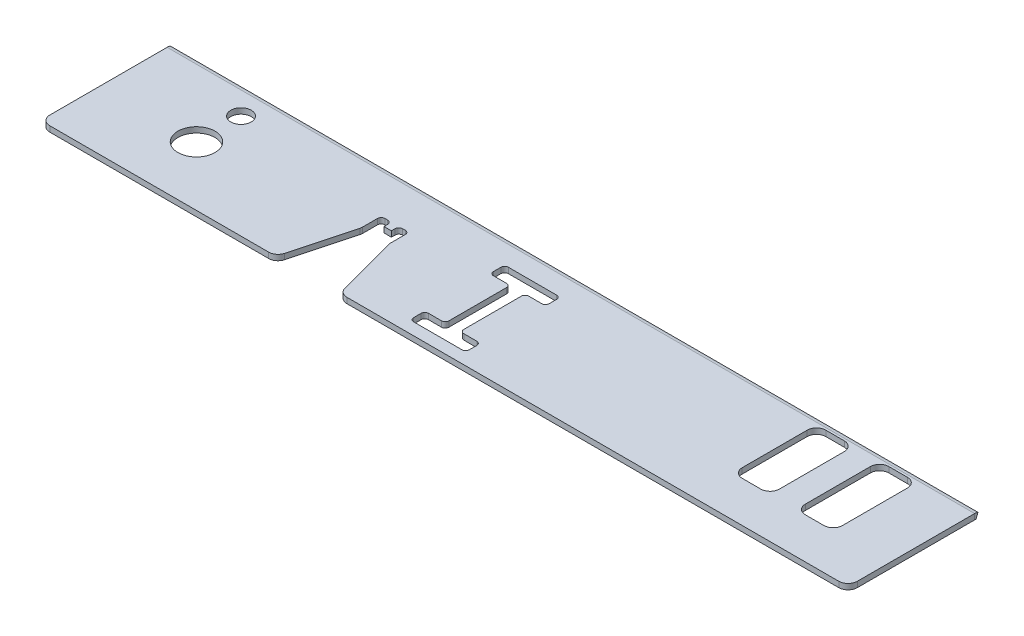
ISO-10303-21;
HEADER;
FILE_DESCRIPTION(('STEP AP214'),'2;1');
FILE_NAME('part.step','',(''),(''),'','','');
FILE_SCHEMA(('AUTOMOTIVE_DESIGN { 1 0 10303 214 1 1 1 1 }'));
ENDSEC;
DATA;
#1=APPLICATION_CONTEXT('core data for automotive mechanical design processes');
#2=APPLICATION_PROTOCOL_DEFINITION('international standard','automotive_design',2000,#1);
#3=PRODUCT_CONTEXT('',#1,'mechanical');
#4=PRODUCT('Part','Part','',(#3));
#5=PRODUCT_RELATED_PRODUCT_CATEGORY('part','',(#4));
#6=PRODUCT_DEFINITION_FORMATION('','',#4);
#7=PRODUCT_DEFINITION_CONTEXT('part definition',#1,'design');
#8=PRODUCT_DEFINITION('design','',#6,#7);
#9=PRODUCT_DEFINITION_SHAPE('','',#8);
#10=(LENGTH_UNIT() NAMED_UNIT(*) SI_UNIT(.MILLI.,.METRE.));
#11=(NAMED_UNIT(*) PLANE_ANGLE_UNIT() SI_UNIT($,.RADIAN.));
#12=(NAMED_UNIT(*) SI_UNIT($,.STERADIAN.) SOLID_ANGLE_UNIT());
#13=UNCERTAINTY_MEASURE_WITH_UNIT(LENGTH_MEASURE(1.E-05),#10,'distance_accuracy_value','');
#14=(GEOMETRIC_REPRESENTATION_CONTEXT(3) GLOBAL_UNCERTAINTY_ASSIGNED_CONTEXT((#13)) GLOBAL_UNIT_ASSIGNED_CONTEXT((#10,
#11,#12)) REPRESENTATION_CONTEXT('',''));
#15=CARTESIAN_POINT('',(0.,0.,0.));
#16=DIRECTION('',(0.,0.,1.));
#17=DIRECTION('',(1.,0.,0.));
#18=AXIS2_PLACEMENT_3D('',#15,#16,#17);
#19=CARTESIAN_POINT('',(435.,154.2,4.8));
#20=DIRECTION('',(-1.,0.,0.));
#21=DIRECTION('',(0.,0.,1.));
#22=AXIS2_PLACEMENT_3D('',#19,#20,#21);
#23=PLANE('',#22);
#24=CARTESIAN_POINT('',(435.,154.2,4.8));
#25=DIRECTION('',(-1.,0.,0.));
#26=DIRECTION('',(0.,-1.,0.));
#27=AXIS2_PLACEMENT_3D('',#24,#25,#26);
#28=CIRCLE('',#27,1.8);
#29=CARTESIAN_POINT('',(435.,155.868644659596,4.12499999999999));
#30=VERTEX_POINT('',#29);
#31=CARTESIAN_POINT('',(435.,156.,4.80000000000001));
#32=VERTEX_POINT('',#31);
#33=EDGE_CURVE('E476',#30,#32,#28,.F.);
#34=ORIENTED_EDGE('',*,*,#33,.F.);
#35=DIRECTION('',(0.,0.927024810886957,-0.375000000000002));
#36=VECTOR('',#35,1.);
#37=CARTESIAN_POINT('',(435.,158.649719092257,3.));
#38=LINE('',#37,#36);
#39=CARTESIAN_POINT('',(435.,158.649719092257,3.));
#40=VERTEX_POINT('',#39);
#41=EDGE_CURVE('E52',#40,#30,#38,.F.);
#42=ORIENTED_EDGE('',*,*,#41,.F.);
#43=CARTESIAN_POINT('',(435.,154.2,4.8));
#44=DIRECTION('',(-1.,0.,0.));
#45=DIRECTION('',(0.,-1.,0.));
#46=AXIS2_PLACEMENT_3D('',#43,#44,#45);
#47=CIRCLE('',#46,4.8);
#48=CARTESIAN_POINT('',(435.,159.,4.8));
#49=VERTEX_POINT('',#48);
#50=EDGE_CURVE('E59',#40,#49,#47,.F.);
#51=ORIENTED_EDGE('',*,*,#50,.T.);
#52=DIRECTION('',(0.,-1.,0.));
#53=VECTOR('',#52,1.);
#54=CARTESIAN_POINT('',(435.,156.,4.8));
#55=LINE('',#54,#53);
#56=EDGE_CURVE('E45',#49,#32,#55,.T.);
#57=ORIENTED_EDGE('',*,*,#56,.T.);
#58=EDGE_LOOP('',(#34,#42,#51,#57));
#59=FACE_BOUND('',#58,.T.);
#60=ADVANCED_FACE('F37',(#59),#23,.F.);
#61=CARTESIAN_POINT('',(0.,154.2,4.8));
#62=DIRECTION('',(1.,0.,0.));
#63=DIRECTION('',(0.,1.,0.));
#64=AXIS2_PLACEMENT_3D('',#61,#62,#63);
#65=PLANE('',#64);
#66=CARTESIAN_POINT('',(0.,154.2,4.8));
#67=DIRECTION('',(-1.,0.,0.));
#68=DIRECTION('',(0.,-1.,0.));
#69=AXIS2_PLACEMENT_3D('',#66,#67,#68);
#70=CIRCLE('',#69,4.8);
#71=CARTESIAN_POINT('',(0.,159.,4.8));
#72=VERTEX_POINT('',#71);
#73=CARTESIAN_POINT('',(0.,158.649719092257,3.));
#74=VERTEX_POINT('',#73);
#75=EDGE_CURVE('E465',#72,#74,#70,.T.);
#76=ORIENTED_EDGE('',*,*,#75,.T.);
#77=DIRECTION('',(0.,0.927024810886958,-0.374999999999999));
#78=VECTOR('',#77,1.);
#79=CARTESIAN_POINT('',(0.,158.649719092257,3.));
#80=LINE('',#79,#78);
#81=CARTESIAN_POINT('',(0.,155.868644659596,4.125));
#82=VERTEX_POINT('',#81);
#83=EDGE_CURVE('E450',#74,#82,#80,.F.);
#84=ORIENTED_EDGE('',*,*,#83,.T.);
#85=CARTESIAN_POINT('',(0.,154.2,4.8));
#86=DIRECTION('',(-1.,0.,0.));
#87=DIRECTION('',(0.,-1.,0.));
#88=AXIS2_PLACEMENT_3D('',#85,#86,#87);
#89=CIRCLE('',#88,1.8);
#90=CARTESIAN_POINT('',(0.,156.,4.8));
#91=VERTEX_POINT('',#90);
#92=EDGE_CURVE('E473',#91,#82,#89,.T.);
#93=ORIENTED_EDGE('',*,*,#92,.F.);
#94=DIRECTION('',(0.,1.,0.));
#95=VECTOR('',#94,1.);
#96=CARTESIAN_POINT('',(0.,156.,4.8));
#97=LINE('',#96,#95);
#98=EDGE_CURVE('E11',#91,#72,#97,.T.);
#99=ORIENTED_EDGE('',*,*,#98,.T.);
#100=EDGE_LOOP('',(#76,#84,#93,#99));
#101=FACE_BOUND('',#100,.T.);
#102=ADVANCED_FACE('F467',(#101),#65,.F.);
#103=CARTESIAN_POINT('',(1037.13651842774,154.2,4.8));
#104=DIRECTION('',(-1.,0.,0.));
#105=DIRECTION('',(0.,-1.,0.));
#106=AXIS2_PLACEMENT_3D('',#103,#104,#105);
#107=CYLINDRICAL_SURFACE('',#106,4.8);
#108=ORIENTED_EDGE('',*,*,#50,.F.);
#109=DIRECTION('',(-1.,0.,0.));
#110=VECTOR('',#109,1.);
#111=CARTESIAN_POINT('',(1037.13651842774,158.649719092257,3.));
#112=LINE('',#111,#110);
#113=EDGE_CURVE('E453',#74,#40,#112,.F.);
#114=ORIENTED_EDGE('',*,*,#113,.F.);
#115=ORIENTED_EDGE('',*,*,#75,.F.);
#116=DIRECTION('',(-1.,0.,0.));
#117=VECTOR('',#116,1.);
#118=CARTESIAN_POINT('',(320.5,159.,4.80000000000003));
#119=LINE('',#118,#117);
#120=EDGE_CURVE('E946',#49,#72,#119,.T.);
#121=ORIENTED_EDGE('',*,*,#120,.F.);
#122=EDGE_LOOP('',(#108,#114,#115,#121));
#123=FACE_BOUND('',#122,.T.);
#124=ADVANCED_FACE('F463',(#123),#107,.T.);
#125=CARTESIAN_POINT('',(1037.13651842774,154.2,4.8));
#126=DIRECTION('',(-1.,0.,0.));
#127=DIRECTION('',(0.,-1.,0.));
#128=AXIS2_PLACEMENT_3D('',#125,#126,#127);
#129=CYLINDRICAL_SURFACE('',#128,1.8);
#130=DIRECTION('',(-1.,0.,0.));
#131=VECTOR('',#130,1.);
#132=CARTESIAN_POINT('',(1037.13651842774,155.868644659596,4.125));
#133=LINE('',#132,#131);
#134=EDGE_CURVE('E454',#82,#30,#133,.F.);
#135=ORIENTED_EDGE('',*,*,#134,.T.);
#136=ORIENTED_EDGE('',*,*,#33,.T.);
#137=DIRECTION('',(-1.,0.,0.));
#138=VECTOR('',#137,1.);
#139=CARTESIAN_POINT('',(320.5,156.,4.8));
#140=LINE('',#139,#138);
#141=EDGE_CURVE('E942',#32,#91,#140,.T.);
#142=ORIENTED_EDGE('',*,*,#141,.T.);
#143=ORIENTED_EDGE('',*,*,#92,.T.);
#144=EDGE_LOOP('',(#135,#136,#142,#143));
#145=FACE_BOUND('',#144,.T.);
#146=ADVANCED_FACE('F975',(#145),#129,.F.);
#147=CARTESIAN_POINT('',(320.5,159.,-165.2));
#148=DIRECTION('',(0.,1.,0.));
#149=DIRECTION('',(-1.,0.,0.));
#150=AXIS2_PLACEMENT_3D('',#147,#148,#149);
#151=PLANE('',#150);
#152=DIRECTION('',(-1.,0.,0.));
#153=VECTOR('',#152,1.);
#154=CARTESIAN_POINT('',(390.,159.,51.0000000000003));
#155=LINE('',#154,#153);
#156=CARTESIAN_POINT('',(400.,159.,51.0000000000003));
#157=VERTEX_POINT('',#156);
#158=CARTESIAN_POINT('',(390.,159.,51.0000000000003));
#159=VERTEX_POINT('',#158);
#160=EDGE_CURVE('E496',#157,#159,#155,.T.);
#161=ORIENTED_EDGE('',*,*,#160,.T.);
#162=CARTESIAN_POINT('',(390.,159.,46.0000000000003));
#163=DIRECTION('',(0.,-1.,0.));
#164=DIRECTION('',(-1.,0.,0.));
#165=AXIS2_PLACEMENT_3D('',#162,#163,#164);
#166=CIRCLE('',#165,5.00000000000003);
#167=CARTESIAN_POINT('',(385.,159.,46.0000000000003));
#168=VERTEX_POINT('',#167);
#169=EDGE_CURVE('E468',#159,#168,#166,.T.);
#170=ORIENTED_EDGE('',*,*,#169,.T.);
#171=DIRECTION('',(0.,0.,-1.));
#172=VECTOR('',#171,1.);
#173=CARTESIAN_POINT('',(385.,159.,46.0000000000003));
#174=LINE('',#173,#172);
#175=CARTESIAN_POINT('',(385.,159.,11.0000000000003));
#176=VERTEX_POINT('',#175);
#177=EDGE_CURVE('E471',#168,#176,#174,.T.);
#178=ORIENTED_EDGE('',*,*,#177,.T.);
#179=CARTESIAN_POINT('',(390.,159.,11.0000000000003));
#180=DIRECTION('',(0.,-1.,0.));
#181=DIRECTION('',(-1.,0.,0.));
#182=AXIS2_PLACEMENT_3D('',#179,#180,#181);
#183=CIRCLE('',#182,4.99999999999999);
#184=CARTESIAN_POINT('',(390.,159.,6.00000000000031));
#185=VERTEX_POINT('',#184);
#186=EDGE_CURVE('E481',#176,#185,#183,.T.);
#187=ORIENTED_EDGE('',*,*,#186,.T.);
#188=DIRECTION('',(1.,0.,0.));
#189=VECTOR('',#188,1.);
#190=CARTESIAN_POINT('',(390.,159.,6.00000000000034));
#191=LINE('',#190,#189);
#192=CARTESIAN_POINT('',(400.,159.,6.00000000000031));
#193=VERTEX_POINT('',#192);
#194=EDGE_CURVE('E484',#185,#193,#191,.T.);
#195=ORIENTED_EDGE('',*,*,#194,.T.);
#196=CARTESIAN_POINT('',(400.,159.,11.0000000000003));
#197=DIRECTION('',(0.,-1.,0.));
#198=DIRECTION('',(-1.,0.,0.));
#199=AXIS2_PLACEMENT_3D('',#196,#197,#198);
#200=CIRCLE('',#199,5.00000000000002);
#201=CARTESIAN_POINT('',(405.,159.,11.0000000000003));
#202=VERTEX_POINT('',#201);
#203=EDGE_CURVE('E487',#193,#202,#200,.T.);
#204=ORIENTED_EDGE('',*,*,#203,.T.);
#205=DIRECTION('',(0.,0.,1.));
#206=VECTOR('',#205,1.);
#207=CARTESIAN_POINT('',(405.,159.,46.0000000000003));
#208=LINE('',#207,#206);
#209=CARTESIAN_POINT('',(405.,159.,46.0000000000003));
#210=VERTEX_POINT('',#209);
#211=EDGE_CURVE('E490',#202,#210,#208,.T.);
#212=ORIENTED_EDGE('',*,*,#211,.T.);
#213=CARTESIAN_POINT('',(400.,159.,46.0000000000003));
#214=DIRECTION('',(0.,-1.,0.));
#215=DIRECTION('',(-1.,0.,0.));
#216=AXIS2_PLACEMENT_3D('',#213,#214,#215);
#217=CIRCLE('',#216,4.99999999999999);
#218=EDGE_CURVE('E493',#210,#157,#217,.T.);
#219=ORIENTED_EDGE('',*,*,#218,.T.);
#220=EDGE_LOOP('',(#161,#170,#178,#187,#195,#204,#212,#219));
#221=FACE_BOUND('',#220,.T.);
#222=CARTESIAN_POINT('',(52.,159.,41.0000000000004));
#223=DIRECTION('',(0.,-1.,0.));
#224=DIRECTION('',(1.,0.,0.));
#225=AXIS2_PLACEMENT_3D('',#222,#223,#224);
#226=CIRCLE('',#225,10.);
#227=CARTESIAN_POINT('',(62.,159.,41.0000000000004));
#228=VERTEX_POINT('',#227);
#229=EDGE_CURVE('E765',#228,#228,#226,.T.);
#230=ORIENTED_EDGE('',*,*,#229,.T.);
#231=EDGE_LOOP('',(#230));
#232=FACE_BOUND('',#231,.T.);
#233=CARTESIAN_POINT('',(52.,159.,17.0000000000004));
#234=DIRECTION('',(0.,-1.,0.));
#235=DIRECTION('',(1.,0.,0.));
#236=AXIS2_PLACEMENT_3D('',#233,#234,#235);
#237=CIRCLE('',#236,5.5);
#238=CARTESIAN_POINT('',(57.5,159.,17.0000000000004));
#239=VERTEX_POINT('',#238);
#240=EDGE_CURVE('E771',#239,#239,#237,.T.);
#241=ORIENTED_EDGE('',*,*,#240,.T.);
#242=EDGE_LOOP('',(#241));
#243=FACE_BOUND('',#242,.T.);
#244=DIRECTION('',(0.,0.,1.));
#245=VECTOR('',#244,1.);
#246=CARTESIAN_POINT('',(211.5,159.,56.5000000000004));
#247=LINE('',#246,#245);
#248=CARTESIAN_POINT('',(211.5,159.,25.5000000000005));
#249=VERTEX_POINT('',#248);
#250=CARTESIAN_POINT('',(211.5,159.,56.5000000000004));
#251=VERTEX_POINT('',#250);
#252=EDGE_CURVE('E662',#249,#251,#247,.T.);
#253=ORIENTED_EDGE('',*,*,#252,.T.);
#254=CARTESIAN_POINT('',(213.5,159.,56.5000000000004));
#255=DIRECTION('',(0.,1.,0.));
#256=DIRECTION('',(-1.,0.,0.));
#257=AXIS2_PLACEMENT_3D('',#254,#255,#256);
#258=CIRCLE('',#257,2.);
#259=CARTESIAN_POINT('',(213.5,159.,58.5000000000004));
#260=VERTEX_POINT('',#259);
#261=EDGE_CURVE('E593',#251,#260,#258,.T.);
#262=ORIENTED_EDGE('',*,*,#261,.T.);
#263=DIRECTION('',(1.,0.,0.));
#264=VECTOR('',#263,1.);
#265=CARTESIAN_POINT('',(213.5,159.,58.5000000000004));
#266=LINE('',#265,#264);
#267=CARTESIAN_POINT('',(220.5,159.,58.5000000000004));
#268=VERTEX_POINT('',#267);
#269=EDGE_CURVE('E596',#260,#268,#266,.T.);
#270=ORIENTED_EDGE('',*,*,#269,.T.);
#271=CARTESIAN_POINT('',(220.5,159.,60.5000000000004));
#272=DIRECTION('',(0.,-1.,0.));
#273=DIRECTION('',(1.,0.,0.));
#274=AXIS2_PLACEMENT_3D('',#271,#272,#273);
#275=CIRCLE('',#274,1.99999999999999);
#276=CARTESIAN_POINT('',(222.5,159.,60.5000000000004));
#277=VERTEX_POINT('',#276);
#278=EDGE_CURVE('E599',#268,#277,#275,.T.);
#279=ORIENTED_EDGE('',*,*,#278,.T.);
#280=DIRECTION('',(0.,0.,1.));
#281=VECTOR('',#280,1.);
#282=CARTESIAN_POINT('',(222.5,159.,60.5000000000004));
#283=LINE('',#282,#281);
#284=CARTESIAN_POINT('',(222.5,159.,64.5000000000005));
#285=VERTEX_POINT('',#284);
#286=EDGE_CURVE('E602',#277,#285,#283,.T.);
#287=ORIENTED_EDGE('',*,*,#286,.T.);
#288=CARTESIAN_POINT('',(220.5,159.,64.5000000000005));
#289=DIRECTION('',(0.,-1.,0.));
#290=DIRECTION('',(1.,0.,0.));
#291=AXIS2_PLACEMENT_3D('',#288,#289,#290);
#292=CIRCLE('',#291,1.99999999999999);
#293=CARTESIAN_POINT('',(220.5,159.,66.5000000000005));
#294=VERTEX_POINT('',#293);
#295=EDGE_CURVE('E605',#285,#294,#292,.T.);
#296=ORIENTED_EDGE('',*,*,#295,.T.);
#297=DIRECTION('',(-1.,0.,0.));
#298=VECTOR('',#297,1.);
#299=CARTESIAN_POINT('',(194.5,159.,66.5000000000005));
#300=LINE('',#299,#298);
#301=CARTESIAN_POINT('',(194.5,159.,66.5000000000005));
#302=VERTEX_POINT('',#301);
#303=EDGE_CURVE('E608',#294,#302,#300,.T.);
#304=ORIENTED_EDGE('',*,*,#303,.T.);
#305=CARTESIAN_POINT('',(194.5,159.,64.5000000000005));
#306=DIRECTION('',(0.,-1.,0.));
#307=DIRECTION('',(1.,0.,0.));
#308=AXIS2_PLACEMENT_3D('',#305,#306,#307);
#309=CIRCLE('',#308,1.99999999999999);
#310=CARTESIAN_POINT('',(192.5,159.,64.5000000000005));
#311=VERTEX_POINT('',#310);
#312=EDGE_CURVE('E611',#302,#311,#309,.T.);
#313=ORIENTED_EDGE('',*,*,#312,.T.);
#314=DIRECTION('',(0.,0.,-1.));
#315=VECTOR('',#314,1.);
#316=CARTESIAN_POINT('',(192.5,159.,60.5000000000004));
#317=LINE('',#316,#315);
#318=CARTESIAN_POINT('',(192.5,159.,60.5000000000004));
#319=VERTEX_POINT('',#318);
#320=EDGE_CURVE('E614',#311,#319,#317,.T.);
#321=ORIENTED_EDGE('',*,*,#320,.T.);
#322=CARTESIAN_POINT('',(194.5,159.,60.5000000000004));
#323=DIRECTION('',(0.,-1.,0.));
#324=DIRECTION('',(1.,0.,0.));
#325=AXIS2_PLACEMENT_3D('',#322,#323,#324);
#326=CIRCLE('',#325,1.99999999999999);
#327=CARTESIAN_POINT('',(194.5,159.,58.5000000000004));
#328=VERTEX_POINT('',#327);
#329=EDGE_CURVE('E617',#319,#328,#326,.T.);
#330=ORIENTED_EDGE('',*,*,#329,.T.);
#331=DIRECTION('',(1.,0.,0.));
#332=VECTOR('',#331,1.);
#333=CARTESIAN_POINT('',(194.5,159.,58.5000000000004));
#334=LINE('',#333,#332);
#335=CARTESIAN_POINT('',(201.5,159.,58.5000000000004));
#336=VERTEX_POINT('',#335);
#337=EDGE_CURVE('E620',#328,#336,#334,.T.);
#338=ORIENTED_EDGE('',*,*,#337,.T.);
#339=CARTESIAN_POINT('',(201.5,159.,56.5000000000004));
#340=DIRECTION('',(0.,1.,0.));
#341=DIRECTION('',(-1.,0.,0.));
#342=AXIS2_PLACEMENT_3D('',#339,#340,#341);
#343=CIRCLE('',#342,2.);
#344=CARTESIAN_POINT('',(203.5,159.,56.5000000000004));
#345=VERTEX_POINT('',#344);
#346=EDGE_CURVE('E623',#336,#345,#343,.T.);
#347=ORIENTED_EDGE('',*,*,#346,.T.);
#348=DIRECTION('',(0.,0.,-1.));
#349=VECTOR('',#348,1.);
#350=CARTESIAN_POINT('',(203.5,159.,56.5000000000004));
#351=LINE('',#350,#349);
#352=CARTESIAN_POINT('',(203.5,159.,25.5000000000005));
#353=VERTEX_POINT('',#352);
#354=EDGE_CURVE('E626',#345,#353,#351,.T.);
#355=ORIENTED_EDGE('',*,*,#354,.T.);
#356=CARTESIAN_POINT('',(201.5,159.,25.5000000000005));
#357=DIRECTION('',(0.,1.,0.));
#358=DIRECTION('',(1.,0.,0.));
#359=AXIS2_PLACEMENT_3D('',#356,#357,#358);
#360=CIRCLE('',#359,2.);
#361=CARTESIAN_POINT('',(201.5,159.,23.5000000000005));
#362=VERTEX_POINT('',#361);
#363=EDGE_CURVE('E629',#353,#362,#360,.T.);
#364=ORIENTED_EDGE('',*,*,#363,.T.);
#365=DIRECTION('',(-1.,0.,0.));
#366=VECTOR('',#365,1.);
#367=CARTESIAN_POINT('',(194.5,159.,23.5000000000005));
#368=LINE('',#367,#366);
#369=CARTESIAN_POINT('',(194.5,159.,23.5000000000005));
#370=VERTEX_POINT('',#369);
#371=EDGE_CURVE('E632',#362,#370,#368,.T.);
#372=ORIENTED_EDGE('',*,*,#371,.T.);
#373=CARTESIAN_POINT('',(194.5,159.,21.5000000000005));
#374=DIRECTION('',(0.,-1.,0.));
#375=DIRECTION('',(-1.,0.,0.));
#376=AXIS2_PLACEMENT_3D('',#373,#374,#375);
#377=CIRCLE('',#376,1.99999999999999);
#378=CARTESIAN_POINT('',(192.5,159.,21.5000000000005));
#379=VERTEX_POINT('',#378);
#380=EDGE_CURVE('E635',#370,#379,#377,.T.);
#381=ORIENTED_EDGE('',*,*,#380,.T.);
#382=DIRECTION('',(0.,0.,-1.));
#383=VECTOR('',#382,1.);
#384=CARTESIAN_POINT('',(192.5,159.,21.5000000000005));
#385=LINE('',#384,#383);
#386=CARTESIAN_POINT('',(192.5,159.,17.5000000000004));
#387=VERTEX_POINT('',#386);
#388=EDGE_CURVE('E638',#379,#387,#385,.T.);
#389=ORIENTED_EDGE('',*,*,#388,.T.);
#390=CARTESIAN_POINT('',(194.5,159.,17.5000000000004));
#391=DIRECTION('',(0.,-1.,0.));
#392=DIRECTION('',(-1.,0.,0.));
#393=AXIS2_PLACEMENT_3D('',#390,#391,#392);
#394=CIRCLE('',#393,1.99999999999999);
#395=CARTESIAN_POINT('',(194.5,159.,15.5000000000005));
#396=VERTEX_POINT('',#395);
#397=EDGE_CURVE('E641',#387,#396,#394,.T.);
#398=ORIENTED_EDGE('',*,*,#397,.T.);
#399=DIRECTION('',(1.,0.,0.));
#400=VECTOR('',#399,1.);
#401=CARTESIAN_POINT('',(194.5,159.,15.5000000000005));
#402=LINE('',#401,#400);
#403=CARTESIAN_POINT('',(220.5,159.,15.5000000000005));
#404=VERTEX_POINT('',#403);
#405=EDGE_CURVE('E644',#396,#404,#402,.T.);
#406=ORIENTED_EDGE('',*,*,#405,.T.);
#407=CARTESIAN_POINT('',(220.5,159.,17.5000000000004));
#408=DIRECTION('',(0.,-1.,0.));
#409=DIRECTION('',(-1.,0.,0.));
#410=AXIS2_PLACEMENT_3D('',#407,#408,#409);
#411=CIRCLE('',#410,1.99999999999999);
#412=CARTESIAN_POINT('',(222.5,159.,17.5000000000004));
#413=VERTEX_POINT('',#412);
#414=EDGE_CURVE('E647',#404,#413,#411,.T.);
#415=ORIENTED_EDGE('',*,*,#414,.T.);
#416=DIRECTION('',(0.,0.,1.));
#417=VECTOR('',#416,1.);
#418=CARTESIAN_POINT('',(222.5,159.,21.5000000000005));
#419=LINE('',#418,#417);
#420=CARTESIAN_POINT('',(222.5,159.,21.5000000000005));
#421=VERTEX_POINT('',#420);
#422=EDGE_CURVE('E650',#413,#421,#419,.T.);
#423=ORIENTED_EDGE('',*,*,#422,.T.);
#424=CARTESIAN_POINT('',(220.5,159.,21.5000000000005));
#425=DIRECTION('',(0.,-1.,0.));
#426=DIRECTION('',(-1.,0.,0.));
#427=AXIS2_PLACEMENT_3D('',#424,#425,#426);
#428=CIRCLE('',#427,1.99999999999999);
#429=CARTESIAN_POINT('',(220.5,159.,23.5000000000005));
#430=VERTEX_POINT('',#429);
#431=EDGE_CURVE('E653',#421,#430,#428,.T.);
#432=ORIENTED_EDGE('',*,*,#431,.T.);
#433=DIRECTION('',(-1.,0.,0.));
#434=VECTOR('',#433,1.);
#435=CARTESIAN_POINT('',(213.5,159.,23.5000000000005));
#436=LINE('',#435,#434);
#437=CARTESIAN_POINT('',(213.5,159.,23.5000000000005));
#438=VERTEX_POINT('',#437);
#439=EDGE_CURVE('E656',#430,#438,#436,.T.);
#440=ORIENTED_EDGE('',*,*,#439,.T.);
#441=CARTESIAN_POINT('',(213.5,159.,25.5000000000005));
#442=DIRECTION('',(0.,1.,0.));
#443=DIRECTION('',(1.,0.,0.));
#444=AXIS2_PLACEMENT_3D('',#441,#442,#443);
#445=CIRCLE('',#444,2.);
#446=EDGE_CURVE('E659',#438,#249,#445,.T.);
#447=ORIENTED_EDGE('',*,*,#446,.T.);
#448=EDGE_LOOP('',(#253,#262,#270,#279,#287,#296,#304,#313,#321,#330,#338,#347,#355,#364,#372,
#381,#389,#398,#406,#415,#423,#432,#440,#447));
#449=FACE_BOUND('',#448,.T.);
#450=DIRECTION('',(-1.,0.,0.));
#451=VECTOR('',#450,1.);
#452=CARTESIAN_POINT('',(356.,159.,51.0000000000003));
#453=LINE('',#452,#451);
#454=CARTESIAN_POINT('',(366.,159.,51.0000000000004));
#455=VERTEX_POINT('',#454);
#456=CARTESIAN_POINT('',(356.,159.,51.0000000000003));
#457=VERTEX_POINT('',#456);
#458=EDGE_CURVE('E555',#455,#457,#453,.T.);
#459=ORIENTED_EDGE('',*,*,#458,.T.);
#460=CARTESIAN_POINT('',(356.,159.,46.0000000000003));
#461=DIRECTION('',(0.,-1.,0.));
#462=DIRECTION('',(-1.,0.,0.));
#463=AXIS2_PLACEMENT_3D('',#460,#461,#462);
#464=CIRCLE('',#463,5.);
#465=CARTESIAN_POINT('',(351.,159.,46.0000000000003));
#466=VERTEX_POINT('',#465);
#467=EDGE_CURVE('E534',#457,#466,#464,.T.);
#468=ORIENTED_EDGE('',*,*,#467,.T.);
#469=DIRECTION('',(0.,0.,-1.));
#470=VECTOR('',#469,1.);
#471=CARTESIAN_POINT('',(351.,159.,46.0000000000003));
#472=LINE('',#471,#470);
#473=CARTESIAN_POINT('',(351.,159.,11.0000000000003));
#474=VERTEX_POINT('',#473);
#475=EDGE_CURVE('E537',#466,#474,#472,.T.);
#476=ORIENTED_EDGE('',*,*,#475,.T.);
#477=CARTESIAN_POINT('',(356.,159.,11.0000000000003));
#478=DIRECTION('',(0.,-1.,0.));
#479=DIRECTION('',(-1.,0.,0.));
#480=AXIS2_PLACEMENT_3D('',#477,#478,#479);
#481=CIRCLE('',#480,5.00000000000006);
#482=CARTESIAN_POINT('',(356.,159.,6.00000000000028));
#483=VERTEX_POINT('',#482);
#484=EDGE_CURVE('E540',#474,#483,#481,.T.);
#485=ORIENTED_EDGE('',*,*,#484,.T.);
#486=DIRECTION('',(1.,0.,0.));
#487=VECTOR('',#486,1.);
#488=CARTESIAN_POINT('',(356.,159.,6.00000000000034));
#489=LINE('',#488,#487);
#490=CARTESIAN_POINT('',(366.,159.,6.00000000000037));
#491=VERTEX_POINT('',#490);
#492=EDGE_CURVE('E543',#483,#491,#489,.T.);
#493=ORIENTED_EDGE('',*,*,#492,.T.);
#494=CARTESIAN_POINT('',(366.,159.,11.0000000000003));
#495=DIRECTION('',(0.,-1.,0.));
#496=DIRECTION('',(-1.,0.,0.));
#497=AXIS2_PLACEMENT_3D('',#494,#495,#496);
#498=CIRCLE('',#497,4.99999999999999);
#499=CARTESIAN_POINT('',(371.,159.,11.0000000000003));
#500=VERTEX_POINT('',#499);
#501=EDGE_CURVE('E546',#491,#500,#498,.T.);
#502=ORIENTED_EDGE('',*,*,#501,.T.);
#503=DIRECTION('',(0.,0.,1.));
#504=VECTOR('',#503,1.);
#505=CARTESIAN_POINT('',(371.,159.,46.0000000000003));
#506=LINE('',#505,#504);
#507=CARTESIAN_POINT('',(371.,159.,46.0000000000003));
#508=VERTEX_POINT('',#507);
#509=EDGE_CURVE('E549',#500,#508,#506,.T.);
#510=ORIENTED_EDGE('',*,*,#509,.T.);
#511=CARTESIAN_POINT('',(366.,159.,46.0000000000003));
#512=DIRECTION('',(0.,-1.,0.));
#513=DIRECTION('',(-1.,0.,0.));
#514=AXIS2_PLACEMENT_3D('',#511,#512,#513);
#515=CIRCLE('',#514,5.00000000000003);
#516=EDGE_CURVE('E552',#508,#455,#515,.T.);
#517=ORIENTED_EDGE('',*,*,#516,.T.);
#518=EDGE_LOOP('',(#459,#468,#476,#485,#493,#502,#510,#517));
#519=FACE_BOUND('',#518,.T.);
#520=DIRECTION('',(0.,0.,1.));
#521=VECTOR('',#520,1.);
#522=CARTESIAN_POINT('',(435.,159.,68.0000000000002));
#523=LINE('',#522,#521);
#524=CARTESIAN_POINT('',(435.,159.,68.0000000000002));
#525=VERTEX_POINT('',#524);
#526=EDGE_CURVE('E777',#49,#525,#523,.T.);
#527=ORIENTED_EDGE('',*,*,#526,.F.);
#528=ORIENTED_EDGE('',*,*,#120,.T.);
#529=DIRECTION('',(0.,0.,-1.));
#530=VECTOR('',#529,1.);
#531=CARTESIAN_POINT('',(0.,158.999999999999,68.0000000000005));
#532=LINE('',#531,#530);
#533=CARTESIAN_POINT('',(0.,158.999999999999,68.0000000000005));
#534=VERTEX_POINT('',#533);
#535=EDGE_CURVE('E824',#534,#72,#532,.T.);
#536=ORIENTED_EDGE('',*,*,#535,.F.);
#537=CARTESIAN_POINT('',(5.00000000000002,158.999999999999,68.0000000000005));
#538=DIRECTION('',(0.,-1.,0.));
#539=DIRECTION('',(-1.,0.,0.));
#540=AXIS2_PLACEMENT_3D('',#537,#538,#539);
#541=CIRCLE('',#540,5.);
#542=CARTESIAN_POINT('',(5.00000000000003,158.999999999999,73.0000000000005));
#543=VERTEX_POINT('',#542);
#544=EDGE_CURVE('E822',#543,#534,#541,.T.);
#545=ORIENTED_EDGE('',*,*,#544,.F.);
#546=DIRECTION('',(-1.,0.,0.));
#547=VECTOR('',#546,1.);
#548=CARTESIAN_POINT('',(5.00000000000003,158.999999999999,73.0000000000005));
#549=LINE('',#548,#547);
#550=CARTESIAN_POINT('',(122.925625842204,158.999999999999,73.0000000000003));
#551=VERTEX_POINT('',#550);
#552=EDGE_CURVE('E820',#551,#543,#549,.T.);
#553=ORIENTED_EDGE('',*,*,#552,.F.);
#554=CARTESIAN_POINT('',(122.925625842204,158.999999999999,68.0000000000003));
#555=DIRECTION('',(0.,-1.,0.));
#556=DIRECTION('',(-1.,0.,0.));
#557=AXIS2_PLACEMENT_3D('',#554,#555,#556);
#558=CIRCLE('',#557,5.00000000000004);
#559=CARTESIAN_POINT('',(127.75525497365,158.999999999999,69.2940952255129));
#560=VERTEX_POINT('',#559);
#561=EDGE_CURVE('E818',#560,#551,#558,.T.);
#562=ORIENTED_EDGE('',*,*,#561,.F.);
#563=DIRECTION('',(-0.258819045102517,0.,0.965925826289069));
#564=VECTOR('',#563,1.);
#565=CARTESIAN_POINT('',(136.329629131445,159.,37.2940952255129));
#566=LINE('',#565,#564);
#567=CARTESIAN_POINT('',(136.329629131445,159.,37.2940952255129));
#568=VERTEX_POINT('',#567);
#569=EDGE_CURVE('E816',#568,#560,#566,.T.);
#570=ORIENTED_EDGE('',*,*,#569,.F.);
#571=CARTESIAN_POINT('',(131.5,159.,36.0000000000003));
#572=DIRECTION('',(0.,-1.,0.));
#573=DIRECTION('',(-1.,0.,0.));
#574=AXIS2_PLACEMENT_3D('',#571,#572,#573);
#575=CIRCLE('',#574,5.00000000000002);
#576=CARTESIAN_POINT('',(136.5,159.,36.0000000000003));
#577=VERTEX_POINT('',#576);
#578=EDGE_CURVE('E814',#577,#568,#575,.T.);
#579=ORIENTED_EDGE('',*,*,#578,.F.);
#580=DIRECTION('',(0.,0.,1.));
#581=VECTOR('',#580,1.);
#582=CARTESIAN_POINT('',(136.5,159.,36.0000000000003));
#583=LINE('',#582,#581);
#584=CARTESIAN_POINT('',(136.5,159.,28.0000000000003));
#585=VERTEX_POINT('',#584);
#586=EDGE_CURVE('E812',#585,#577,#583,.T.);
#587=ORIENTED_EDGE('',*,*,#586,.F.);
#588=CARTESIAN_POINT('',(138.5,159.,28.0000000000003));
#589=DIRECTION('',(0.,1.,0.));
#590=DIRECTION('',(-1.,0.,0.));
#591=AXIS2_PLACEMENT_3D('',#588,#589,#590);
#592=CIRCLE('',#591,2.);
#593=CARTESIAN_POINT('',(138.5,159.,26.0000000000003));
#594=VERTEX_POINT('',#593);
#595=EDGE_CURVE('E810',#594,#585,#592,.T.);
#596=ORIENTED_EDGE('',*,*,#595,.F.);
#597=DIRECTION('',(-1.,0.,0.));
#598=VECTOR('',#597,1.);
#599=CARTESIAN_POINT('',(138.5,159.,26.0000000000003));
#600=LINE('',#599,#598);
#601=CARTESIAN_POINT('',(140.,159.,26.0000000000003));
#602=VERTEX_POINT('',#601);
#603=EDGE_CURVE('E808',#602,#594,#600,.T.);
#604=ORIENTED_EDGE('',*,*,#603,.F.);
#605=CARTESIAN_POINT('',(140.,159.,28.0000000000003));
#606=DIRECTION('',(0.,1.,0.));
#607=DIRECTION('',(1.,0.,0.));
#608=AXIS2_PLACEMENT_3D('',#605,#606,#607);
#609=CIRCLE('',#608,2.00000000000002);
#610=CARTESIAN_POINT('',(142.,159.,28.0000000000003));
#611=VERTEX_POINT('',#610);
#612=EDGE_CURVE('E806',#611,#602,#609,.T.);
#613=ORIENTED_EDGE('',*,*,#612,.F.);
#614=DIRECTION('',(0.,0.,-1.));
#615=VECTOR('',#614,1.);
#616=CARTESIAN_POINT('',(142.,159.,28.0000000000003));
#617=LINE('',#616,#615);
#618=CARTESIAN_POINT('',(142.,159.,30.0000000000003));
#619=VERTEX_POINT('',#618);
#620=EDGE_CURVE('E804',#619,#611,#617,.T.);
#621=ORIENTED_EDGE('',*,*,#620,.F.);
#622=DIRECTION('',(-1.,0.,0.));
#623=VECTOR('',#622,1.);
#624=CARTESIAN_POINT('',(146.,159.,30.0000000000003));
#625=LINE('',#624,#623);
#626=CARTESIAN_POINT('',(146.,159.,30.0000000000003));
#627=VERTEX_POINT('',#626);
#628=EDGE_CURVE('E802',#627,#619,#625,.T.);
#629=ORIENTED_EDGE('',*,*,#628,.F.);
#630=DIRECTION('',(0.,0.,1.));
#631=VECTOR('',#630,1.);
#632=CARTESIAN_POINT('',(146.,159.,28.0000000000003));
#633=LINE('',#632,#631);
#634=CARTESIAN_POINT('',(146.,159.,28.0000000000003));
#635=VERTEX_POINT('',#634);
#636=EDGE_CURVE('E800',#635,#627,#633,.T.);
#637=ORIENTED_EDGE('',*,*,#636,.F.);
#638=CARTESIAN_POINT('',(148.,159.,28.0000000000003));
#639=DIRECTION('',(0.,1.,0.));
#640=DIRECTION('',(-1.,0.,0.));
#641=AXIS2_PLACEMENT_3D('',#638,#639,#640);
#642=CIRCLE('',#641,2.00000000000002);
#643=CARTESIAN_POINT('',(148.,159.,26.0000000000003));
#644=VERTEX_POINT('',#643);
#645=EDGE_CURVE('E798',#644,#635,#642,.T.);
#646=ORIENTED_EDGE('',*,*,#645,.F.);
#647=DIRECTION('',(-1.,0.,0.));
#648=VECTOR('',#647,1.);
#649=CARTESIAN_POINT('',(148.,159.,26.0000000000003));
#650=LINE('',#649,#648);
#651=CARTESIAN_POINT('',(149.5,159.,26.0000000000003));
#652=VERTEX_POINT('',#651);
#653=EDGE_CURVE('E796',#652,#644,#650,.T.);
#654=ORIENTED_EDGE('',*,*,#653,.F.);
#655=CARTESIAN_POINT('',(149.5,159.,28.0000000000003));
#656=DIRECTION('',(0.,1.,0.));
#657=DIRECTION('',(1.,0.,0.));
#658=AXIS2_PLACEMENT_3D('',#655,#656,#657);
#659=CIRCLE('',#658,2.);
#660=CARTESIAN_POINT('',(151.5,159.,28.0000000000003));
#661=VERTEX_POINT('',#660);
#662=EDGE_CURVE('E794',#661,#652,#659,.T.);
#663=ORIENTED_EDGE('',*,*,#662,.F.);
#664=DIRECTION('',(0.,0.,-1.));
#665=VECTOR('',#664,1.);
#666=CARTESIAN_POINT('',(151.5,159.,36.0000000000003));
#667=LINE('',#666,#665);
#668=CARTESIAN_POINT('',(151.5,159.,36.0000000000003));
#669=VERTEX_POINT('',#668);
#670=EDGE_CURVE('E792',#669,#661,#667,.T.);
#671=ORIENTED_EDGE('',*,*,#670,.F.);
#672=CARTESIAN_POINT('',(156.5,159.,36.0000000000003));
#673=DIRECTION('',(0.,-1.,0.));
#674=DIRECTION('',(1.,0.,0.));
#675=AXIS2_PLACEMENT_3D('',#672,#673,#674);
#676=CIRCLE('',#675,5.00000000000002);
#677=CARTESIAN_POINT('',(151.670370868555,159.,37.2940952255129));
#678=VERTEX_POINT('',#677);
#679=EDGE_CURVE('E790',#678,#669,#676,.T.);
#680=ORIENTED_EDGE('',*,*,#679,.F.);
#681=DIRECTION('',(-0.258819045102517,0.,-0.965925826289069));
#682=VECTOR('',#681,1.);
#683=CARTESIAN_POINT('',(151.670370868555,159.,37.2940952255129));
#684=LINE('',#683,#682);
#685=CARTESIAN_POINT('',(160.24474502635,158.999999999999,69.2940952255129));
#686=VERTEX_POINT('',#685);
#687=EDGE_CURVE('E788',#686,#678,#684,.T.);
#688=ORIENTED_EDGE('',*,*,#687,.F.);
#689=CARTESIAN_POINT('',(165.074374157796,159.,68.0000000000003));
#690=DIRECTION('',(0.,-1.,0.));
#691=DIRECTION('',(1.,0.,0.));
#692=AXIS2_PLACEMENT_3D('',#689,#690,#691);
#693=CIRCLE('',#692,5.00000000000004);
#694=CARTESIAN_POINT('',(165.074374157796,158.999999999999,73.0000000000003));
#695=VERTEX_POINT('',#694);
#696=EDGE_CURVE('E786',#695,#686,#693,.T.);
#697=ORIENTED_EDGE('',*,*,#696,.F.);
#698=DIRECTION('',(-1.,0.,0.));
#699=VECTOR('',#698,1.);
#700=CARTESIAN_POINT('',(165.074374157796,158.999999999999,73.0000000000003));
#701=LINE('',#700,#699);
#702=CARTESIAN_POINT('',(430.,159.,73.0000000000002));
#703=VERTEX_POINT('',#702);
#704=EDGE_CURVE('E783',#703,#695,#701,.T.);
#705=ORIENTED_EDGE('',*,*,#704,.F.);
#706=CARTESIAN_POINT('',(430.,159.,68.0000000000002));
#707=DIRECTION('',(0.,-1.,0.));
#708=DIRECTION('',(-1.,0.,0.));
#709=AXIS2_PLACEMENT_3D('',#706,#707,#708);
#710=CIRCLE('',#709,5.00000000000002);
#711=EDGE_CURVE('E780',#525,#703,#710,.T.);
#712=ORIENTED_EDGE('',*,*,#711,.F.);
#713=EDGE_LOOP('',(#527,#528,#536,#545,#553,#562,#570,#579,#587,#596,#604,#613,#621,#629,#637,
#646,#654,#663,#671,#680,#688,#697,#705,#712));
#714=FACE_BOUND('',#713,.T.);
#715=ADVANCED_FACE('F957',(#221,#232,#243,#449,#519,#714),#151,.T.);
#716=CARTESIAN_POINT('',(320.5,156.,-165.2));
#717=DIRECTION('',(0.,1.,0.));
#718=DIRECTION('',(-1.,0.,0.));
#719=AXIS2_PLACEMENT_3D('',#716,#717,#718);
#720=PLANE('',#719);
#721=ORIENTED_EDGE('',*,*,#141,.F.);
#722=DIRECTION('',(0.,0.,1.));
#723=VECTOR('',#722,1.);
#724=CARTESIAN_POINT('',(435.,156.,68.0000000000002));
#725=LINE('',#724,#723);
#726=CARTESIAN_POINT('',(435.,156.,68.0000000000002));
#727=VERTEX_POINT('',#726);
#728=EDGE_CURVE('E827',#32,#727,#725,.T.);
#729=ORIENTED_EDGE('',*,*,#728,.T.);
#730=CARTESIAN_POINT('',(430.,156.,68.0000000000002));
#731=DIRECTION('',(0.,-1.,0.));
#732=DIRECTION('',(-1.,0.,0.));
#733=AXIS2_PLACEMENT_3D('',#730,#731,#732);
#734=CIRCLE('',#733,5.00000000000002);
#735=CARTESIAN_POINT('',(430.,155.999999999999,73.0000000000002));
#736=VERTEX_POINT('',#735);
#737=EDGE_CURVE('E829',#727,#736,#734,.T.);
#738=ORIENTED_EDGE('',*,*,#737,.T.);
#739=DIRECTION('',(-1.,0.,0.));
#740=VECTOR('',#739,1.);
#741=CARTESIAN_POINT('',(180.,155.999999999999,73.0000000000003));
#742=LINE('',#741,#740);
#743=CARTESIAN_POINT('',(165.074374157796,155.999999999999,73.0000000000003));
#744=VERTEX_POINT('',#743);
#745=EDGE_CURVE('E831',#736,#744,#742,.T.);
#746=ORIENTED_EDGE('',*,*,#745,.T.);
#747=CARTESIAN_POINT('',(165.074374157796,155.999999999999,68.0000000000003));
#748=DIRECTION('',(0.,-1.,0.));
#749=DIRECTION('',(1.,0.,0.));
#750=AXIS2_PLACEMENT_3D('',#747,#748,#749);
#751=CIRCLE('',#750,5.00000000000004);
#752=CARTESIAN_POINT('',(160.24474502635,155.999999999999,69.2940952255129));
#753=VERTEX_POINT('',#752);
#754=EDGE_CURVE('E833',#744,#753,#751,.T.);
#755=ORIENTED_EDGE('',*,*,#754,.T.);
#756=DIRECTION('',(-0.258819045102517,0.,-0.965925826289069));
#757=VECTOR('',#756,1.);
#758=CARTESIAN_POINT('',(151.670370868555,156.,37.2940952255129));
#759=LINE('',#758,#757);
#760=CARTESIAN_POINT('',(151.670370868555,156.,37.2940952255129));
#761=VERTEX_POINT('',#760);
#762=EDGE_CURVE('E835',#753,#761,#759,.T.);
#763=ORIENTED_EDGE('',*,*,#762,.T.);
#764=CARTESIAN_POINT('',(156.5,156.,36.0000000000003));
#765=DIRECTION('',(0.,-1.,0.));
#766=DIRECTION('',(1.,0.,0.));
#767=AXIS2_PLACEMENT_3D('',#764,#765,#766);
#768=CIRCLE('',#767,5.00000000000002);
#769=CARTESIAN_POINT('',(151.5,156.,36.0000000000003));
#770=VERTEX_POINT('',#769);
#771=EDGE_CURVE('E837',#761,#770,#768,.T.);
#772=ORIENTED_EDGE('',*,*,#771,.T.);
#773=DIRECTION('',(0.,0.,-1.));
#774=VECTOR('',#773,1.);
#775=CARTESIAN_POINT('',(151.5,156.,36.0000000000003));
#776=LINE('',#775,#774);
#777=CARTESIAN_POINT('',(151.5,156.,28.0000000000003));
#778=VERTEX_POINT('',#777);
#779=EDGE_CURVE('E839',#770,#778,#776,.T.);
#780=ORIENTED_EDGE('',*,*,#779,.T.);
#781=CARTESIAN_POINT('',(149.5,156.,28.0000000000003));
#782=DIRECTION('',(0.,1.,0.));
#783=DIRECTION('',(1.,0.,0.));
#784=AXIS2_PLACEMENT_3D('',#781,#782,#783);
#785=CIRCLE('',#784,2.);
#786=CARTESIAN_POINT('',(149.5,156.,26.0000000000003));
#787=VERTEX_POINT('',#786);
#788=EDGE_CURVE('E841',#778,#787,#785,.T.);
#789=ORIENTED_EDGE('',*,*,#788,.T.);
#790=DIRECTION('',(-1.,0.,0.));
#791=VECTOR('',#790,1.);
#792=CARTESIAN_POINT('',(148.,156.,26.0000000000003));
#793=LINE('',#792,#791);
#794=CARTESIAN_POINT('',(148.,156.,26.0000000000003));
#795=VERTEX_POINT('',#794);
#796=EDGE_CURVE('E843',#787,#795,#793,.T.);
#797=ORIENTED_EDGE('',*,*,#796,.T.);
#798=CARTESIAN_POINT('',(148.,156.,28.0000000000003));
#799=DIRECTION('',(0.,1.,0.));
#800=DIRECTION('',(-1.,0.,0.));
#801=AXIS2_PLACEMENT_3D('',#798,#799,#800);
#802=CIRCLE('',#801,2.00000000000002);
#803=CARTESIAN_POINT('',(146.,156.,28.0000000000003));
#804=VERTEX_POINT('',#803);
#805=EDGE_CURVE('E845',#795,#804,#802,.T.);
#806=ORIENTED_EDGE('',*,*,#805,.T.);
#807=DIRECTION('',(0.,0.,1.));
#808=VECTOR('',#807,1.);
#809=CARTESIAN_POINT('',(146.,156.,28.0000000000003));
#810=LINE('',#809,#808);
#811=CARTESIAN_POINT('',(146.,156.,30.0000000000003));
#812=VERTEX_POINT('',#811);
#813=EDGE_CURVE('E847',#804,#812,#810,.T.);
#814=ORIENTED_EDGE('',*,*,#813,.T.);
#815=DIRECTION('',(-1.,0.,0.));
#816=VECTOR('',#815,1.);
#817=CARTESIAN_POINT('',(146.,156.,30.0000000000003));
#818=LINE('',#817,#816);
#819=CARTESIAN_POINT('',(142.,156.,30.0000000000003));
#820=VERTEX_POINT('',#819);
#821=EDGE_CURVE('E849',#812,#820,#818,.T.);
#822=ORIENTED_EDGE('',*,*,#821,.T.);
#823=DIRECTION('',(0.,0.,-1.));
#824=VECTOR('',#823,1.);
#825=CARTESIAN_POINT('',(142.,156.,28.0000000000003));
#826=LINE('',#825,#824);
#827=CARTESIAN_POINT('',(142.,156.,28.0000000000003));
#828=VERTEX_POINT('',#827);
#829=EDGE_CURVE('E851',#820,#828,#826,.T.);
#830=ORIENTED_EDGE('',*,*,#829,.T.);
#831=CARTESIAN_POINT('',(140.,156.,28.0000000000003));
#832=DIRECTION('',(0.,1.,0.));
#833=DIRECTION('',(1.,0.,0.));
#834=AXIS2_PLACEMENT_3D('',#831,#832,#833);
#835=CIRCLE('',#834,2.00000000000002);
#836=CARTESIAN_POINT('',(140.,156.,26.0000000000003));
#837=VERTEX_POINT('',#836);
#838=EDGE_CURVE('E853',#828,#837,#835,.T.);
#839=ORIENTED_EDGE('',*,*,#838,.T.);
#840=DIRECTION('',(-1.,0.,0.));
#841=VECTOR('',#840,1.);
#842=CARTESIAN_POINT('',(138.5,156.,26.0000000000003));
#843=LINE('',#842,#841);
#844=CARTESIAN_POINT('',(138.5,156.,26.0000000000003));
#845=VERTEX_POINT('',#844);
#846=EDGE_CURVE('E855',#837,#845,#843,.T.);
#847=ORIENTED_EDGE('',*,*,#846,.T.);
#848=CARTESIAN_POINT('',(138.5,156.,28.0000000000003));
#849=DIRECTION('',(0.,1.,0.));
#850=DIRECTION('',(-1.,0.,0.));
#851=AXIS2_PLACEMENT_3D('',#848,#849,#850);
#852=CIRCLE('',#851,2.);
#853=CARTESIAN_POINT('',(136.5,156.,28.0000000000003));
#854=VERTEX_POINT('',#853);
#855=EDGE_CURVE('E857',#845,#854,#852,.T.);
#856=ORIENTED_EDGE('',*,*,#855,.T.);
#857=DIRECTION('',(0.,0.,1.));
#858=VECTOR('',#857,1.);
#859=CARTESIAN_POINT('',(136.5,156.,36.0000000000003));
#860=LINE('',#859,#858);
#861=CARTESIAN_POINT('',(136.5,156.,36.0000000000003));
#862=VERTEX_POINT('',#861);
#863=EDGE_CURVE('E859',#854,#862,#860,.T.);
#864=ORIENTED_EDGE('',*,*,#863,.T.);
#865=CARTESIAN_POINT('',(131.5,156.,36.0000000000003));
#866=DIRECTION('',(0.,-1.,0.));
#867=DIRECTION('',(-1.,0.,0.));
#868=AXIS2_PLACEMENT_3D('',#865,#866,#867);
#869=CIRCLE('',#868,5.00000000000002);
#870=CARTESIAN_POINT('',(136.329629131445,156.,37.2940952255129));
#871=VERTEX_POINT('',#870);
#872=EDGE_CURVE('E861',#862,#871,#869,.T.);
#873=ORIENTED_EDGE('',*,*,#872,.T.);
#874=DIRECTION('',(-0.258819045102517,0.,0.965925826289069));
#875=VECTOR('',#874,1.);
#876=CARTESIAN_POINT('',(136.329629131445,156.,37.2940952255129));
#877=LINE('',#876,#875);
#878=CARTESIAN_POINT('',(127.75525497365,155.999999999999,69.2940952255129));
#879=VERTEX_POINT('',#878);
#880=EDGE_CURVE('E863',#871,#879,#877,.T.);
#881=ORIENTED_EDGE('',*,*,#880,.T.);
#882=CARTESIAN_POINT('',(122.925625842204,155.999999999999,68.0000000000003));
#883=DIRECTION('',(0.,-1.,0.));
#884=DIRECTION('',(-1.,0.,0.));
#885=AXIS2_PLACEMENT_3D('',#882,#883,#884);
#886=CIRCLE('',#885,5.00000000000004);
#887=CARTESIAN_POINT('',(122.925625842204,155.999999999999,73.0000000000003));
#888=VERTEX_POINT('',#887);
#889=EDGE_CURVE('E865',#879,#888,#886,.T.);
#890=ORIENTED_EDGE('',*,*,#889,.T.);
#891=DIRECTION('',(-1.,0.,0.));
#892=VECTOR('',#891,1.);
#893=CARTESIAN_POINT('',(5.00000000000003,155.999999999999,73.0000000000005));
#894=LINE('',#893,#892);
#895=CARTESIAN_POINT('',(5.00000000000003,155.999999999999,73.0000000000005));
#896=VERTEX_POINT('',#895);
#897=EDGE_CURVE('E867',#888,#896,#894,.T.);
#898=ORIENTED_EDGE('',*,*,#897,.T.);
#899=CARTESIAN_POINT('',(5.00000000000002,155.999999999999,68.0000000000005));
#900=DIRECTION('',(0.,-1.,0.));
#901=DIRECTION('',(-1.,0.,0.));
#902=AXIS2_PLACEMENT_3D('',#899,#900,#901);
#903=CIRCLE('',#902,5.);
#904=CARTESIAN_POINT('',(0.,155.999999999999,68.0000000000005));
#905=VERTEX_POINT('',#904);
#906=EDGE_CURVE('E870',#896,#905,#903,.T.);
#907=ORIENTED_EDGE('',*,*,#906,.T.);
#908=DIRECTION('',(0.,0.,-1.));
#909=VECTOR('',#908,1.);
#910=CARTESIAN_POINT('',(0.,155.999999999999,68.0000000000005));
#911=LINE('',#910,#909);
#912=EDGE_CURVE('E872',#905,#91,#911,.T.);
#913=ORIENTED_EDGE('',*,*,#912,.T.);
#914=EDGE_LOOP('',(#721,#729,#738,#746,#755,#763,#772,#780,#789,#797,#806,#814,#822,#830,#839,
#847,#856,#864,#873,#881,#890,#898,#907,#913));
#915=FACE_BOUND('',#914,.T.);
#916=CARTESIAN_POINT('',(356.,156.,46.0000000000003));
#917=DIRECTION('',(0.,-1.,0.));
#918=DIRECTION('',(-1.,0.,0.));
#919=AXIS2_PLACEMENT_3D('',#916,#917,#918);
#920=CIRCLE('',#919,5.);
#921=CARTESIAN_POINT('',(356.,156.,51.0000000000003));
#922=VERTEX_POINT('',#921);
#923=CARTESIAN_POINT('',(351.,156.,46.0000000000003));
#924=VERTEX_POINT('',#923);
#925=EDGE_CURVE('E558',#922,#924,#920,.T.);
#926=ORIENTED_EDGE('',*,*,#925,.F.);
#927=DIRECTION('',(-1.,0.,0.));
#928=VECTOR('',#927,1.);
#929=CARTESIAN_POINT('',(356.,156.,51.0000000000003));
#930=LINE('',#929,#928);
#931=CARTESIAN_POINT('',(366.,156.,51.0000000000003));
#932=VERTEX_POINT('',#931);
#933=EDGE_CURVE('E573',#932,#922,#930,.T.);
#934=ORIENTED_EDGE('',*,*,#933,.F.);
#935=CARTESIAN_POINT('',(366.,156.,46.0000000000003));
#936=DIRECTION('',(0.,-1.,0.));
#937=DIRECTION('',(-1.,0.,0.));
#938=AXIS2_PLACEMENT_3D('',#935,#936,#937);
#939=CIRCLE('',#938,5.00000000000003);
#940=CARTESIAN_POINT('',(371.,156.,46.0000000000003));
#941=VERTEX_POINT('',#940);
#942=EDGE_CURVE('E570',#941,#932,#939,.T.);
#943=ORIENTED_EDGE('',*,*,#942,.F.);
#944=DIRECTION('',(0.,0.,1.));
#945=VECTOR('',#944,1.);
#946=CARTESIAN_POINT('',(371.,156.,46.0000000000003));
#947=LINE('',#946,#945);
#948=CARTESIAN_POINT('',(371.,156.,11.0000000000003));
#949=VERTEX_POINT('',#948);
#950=EDGE_CURVE('E568',#949,#941,#947,.T.);
#951=ORIENTED_EDGE('',*,*,#950,.F.);
#952=CARTESIAN_POINT('',(366.,156.,11.0000000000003));
#953=DIRECTION('',(0.,-1.,0.));
#954=DIRECTION('',(-1.,0.,0.));
#955=AXIS2_PLACEMENT_3D('',#952,#953,#954);
#956=CIRCLE('',#955,4.99999999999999);
#957=CARTESIAN_POINT('',(366.,156.,6.00000000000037));
#958=VERTEX_POINT('',#957);
#959=EDGE_CURVE('E566',#958,#949,#956,.T.);
#960=ORIENTED_EDGE('',*,*,#959,.F.);
#961=DIRECTION('',(1.,0.,0.));
#962=VECTOR('',#961,1.);
#963=CARTESIAN_POINT('',(356.,156.,6.00000000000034));
#964=LINE('',#963,#962);
#965=CARTESIAN_POINT('',(356.,156.,6.00000000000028));
#966=VERTEX_POINT('',#965);
#967=EDGE_CURVE('E564',#966,#958,#964,.T.);
#968=ORIENTED_EDGE('',*,*,#967,.F.);
#969=CARTESIAN_POINT('',(356.,156.,11.0000000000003));
#970=DIRECTION('',(0.,-1.,0.));
#971=DIRECTION('',(-1.,0.,0.));
#972=AXIS2_PLACEMENT_3D('',#969,#970,#971);
#973=CIRCLE('',#972,5.00000000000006);
#974=CARTESIAN_POINT('',(351.,156.,11.0000000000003));
#975=VERTEX_POINT('',#974);
#976=EDGE_CURVE('E562',#975,#966,#973,.T.);
#977=ORIENTED_EDGE('',*,*,#976,.F.);
#978=DIRECTION('',(0.,0.,-1.));
#979=VECTOR('',#978,1.);
#980=CARTESIAN_POINT('',(351.,156.,46.0000000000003));
#981=LINE('',#980,#979);
#982=EDGE_CURVE('E560',#924,#975,#981,.T.);
#983=ORIENTED_EDGE('',*,*,#982,.F.);
#984=EDGE_LOOP('',(#926,#934,#943,#951,#960,#968,#977,#983));
#985=FACE_BOUND('',#984,.T.);
#986=CARTESIAN_POINT('',(213.5,156.,56.5000000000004));
#987=DIRECTION('',(0.,1.,0.));
#988=DIRECTION('',(-1.,0.,0.));
#989=AXIS2_PLACEMENT_3D('',#986,#987,#988);
#990=CIRCLE('',#989,2.);
#991=CARTESIAN_POINT('',(211.5,156.,56.5000000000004));
#992=VERTEX_POINT('',#991);
#993=CARTESIAN_POINT('',(213.5,156.,58.5000000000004));
#994=VERTEX_POINT('',#993);
#995=EDGE_CURVE('E665',#992,#994,#990,.T.);
#996=ORIENTED_EDGE('',*,*,#995,.F.);
#997=DIRECTION('',(0.,0.,1.));
#998=VECTOR('',#997,1.);
#999=CARTESIAN_POINT('',(211.5,156.,56.5000000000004));
#1000=LINE('',#999,#998);
#1001=CARTESIAN_POINT('',(211.5,156.,25.5000000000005));
#1002=VERTEX_POINT('',#1001);
#1003=EDGE_CURVE('E713',#1002,#992,#1000,.T.);
#1004=ORIENTED_EDGE('',*,*,#1003,.F.);
#1005=CARTESIAN_POINT('',(213.5,156.,25.5000000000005));
#1006=DIRECTION('',(0.,1.,0.));
#1007=DIRECTION('',(1.,0.,0.));
#1008=AXIS2_PLACEMENT_3D('',#1005,#1006,#1007);
#1009=CIRCLE('',#1008,2.);
#1010=CARTESIAN_POINT('',(213.5,156.,23.5000000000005));
#1011=VERTEX_POINT('',#1010);
#1012=EDGE_CURVE('E710',#1011,#1002,#1009,.T.);
#1013=ORIENTED_EDGE('',*,*,#1012,.F.);
#1014=DIRECTION('',(-1.,0.,0.));
#1015=VECTOR('',#1014,1.);
#1016=CARTESIAN_POINT('',(213.5,156.,23.5000000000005));
#1017=LINE('',#1016,#1015);
#1018=CARTESIAN_POINT('',(220.5,156.,23.5000000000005));
#1019=VERTEX_POINT('',#1018);
#1020=EDGE_CURVE('E708',#1019,#1011,#1017,.T.);
#1021=ORIENTED_EDGE('',*,*,#1020,.F.);
#1022=CARTESIAN_POINT('',(220.5,156.,21.5000000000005));
#1023=DIRECTION('',(0.,-1.,0.));
#1024=DIRECTION('',(-1.,0.,0.));
#1025=AXIS2_PLACEMENT_3D('',#1022,#1023,#1024);
#1026=CIRCLE('',#1025,1.99999999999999);
#1027=CARTESIAN_POINT('',(222.5,156.,21.5000000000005));
#1028=VERTEX_POINT('',#1027);
#1029=EDGE_CURVE('E706',#1028,#1019,#1026,.T.);
#1030=ORIENTED_EDGE('',*,*,#1029,.F.);
#1031=DIRECTION('',(0.,0.,1.));
#1032=VECTOR('',#1031,1.);
#1033=CARTESIAN_POINT('',(222.5,156.,21.5000000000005));
#1034=LINE('',#1033,#1032);
#1035=CARTESIAN_POINT('',(222.5,156.,17.5000000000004));
#1036=VERTEX_POINT('',#1035);
#1037=EDGE_CURVE('E704',#1036,#1028,#1034,.T.);
#1038=ORIENTED_EDGE('',*,*,#1037,.F.);
#1039=CARTESIAN_POINT('',(220.5,156.,17.5000000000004));
#1040=DIRECTION('',(0.,-1.,0.));
#1041=DIRECTION('',(-1.,0.,0.));
#1042=AXIS2_PLACEMENT_3D('',#1039,#1040,#1041);
#1043=CIRCLE('',#1042,1.99999999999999);
#1044=CARTESIAN_POINT('',(220.5,156.,15.5000000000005));
#1045=VERTEX_POINT('',#1044);
#1046=EDGE_CURVE('E702',#1045,#1036,#1043,.T.);
#1047=ORIENTED_EDGE('',*,*,#1046,.F.);
#1048=DIRECTION('',(1.,0.,0.));
#1049=VECTOR('',#1048,1.);
#1050=CARTESIAN_POINT('',(194.5,156.,15.5000000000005));
#1051=LINE('',#1050,#1049);
#1052=CARTESIAN_POINT('',(194.5,156.,15.5000000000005));
#1053=VERTEX_POINT('',#1052);
#1054=EDGE_CURVE('E700',#1053,#1045,#1051,.T.);
#1055=ORIENTED_EDGE('',*,*,#1054,.F.);
#1056=CARTESIAN_POINT('',(194.5,156.,17.5000000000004));
#1057=DIRECTION('',(0.,-1.,0.));
#1058=DIRECTION('',(-1.,0.,0.));
#1059=AXIS2_PLACEMENT_3D('',#1056,#1057,#1058);
#1060=CIRCLE('',#1059,1.99999999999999);
#1061=CARTESIAN_POINT('',(192.5,156.,17.5000000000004));
#1062=VERTEX_POINT('',#1061);
#1063=EDGE_CURVE('E698',#1062,#1053,#1060,.T.);
#1064=ORIENTED_EDGE('',*,*,#1063,.F.);
#1065=DIRECTION('',(0.,0.,-1.));
#1066=VECTOR('',#1065,1.);
#1067=CARTESIAN_POINT('',(192.5,156.,21.5000000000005));
#1068=LINE('',#1067,#1066);
#1069=CARTESIAN_POINT('',(192.5,156.,21.5000000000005));
#1070=VERTEX_POINT('',#1069);
#1071=EDGE_CURVE('E696',#1070,#1062,#1068,.T.);
#1072=ORIENTED_EDGE('',*,*,#1071,.F.);
#1073=CARTESIAN_POINT('',(194.5,156.,21.5000000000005));
#1074=DIRECTION('',(0.,-1.,0.));
#1075=DIRECTION('',(-1.,0.,0.));
#1076=AXIS2_PLACEMENT_3D('',#1073,#1074,#1075);
#1077=CIRCLE('',#1076,1.99999999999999);
#1078=CARTESIAN_POINT('',(194.5,156.,23.5000000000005));
#1079=VERTEX_POINT('',#1078);
#1080=EDGE_CURVE('E694',#1079,#1070,#1077,.T.);
#1081=ORIENTED_EDGE('',*,*,#1080,.F.);
#1082=DIRECTION('',(-1.,0.,0.));
#1083=VECTOR('',#1082,1.);
#1084=CARTESIAN_POINT('',(194.5,156.,23.5000000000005));
#1085=LINE('',#1084,#1083);
#1086=CARTESIAN_POINT('',(201.5,156.,23.5000000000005));
#1087=VERTEX_POINT('',#1086);
#1088=EDGE_CURVE('E692',#1087,#1079,#1085,.T.);
#1089=ORIENTED_EDGE('',*,*,#1088,.F.);
#1090=CARTESIAN_POINT('',(201.5,156.,25.5000000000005));
#1091=DIRECTION('',(0.,1.,0.));
#1092=DIRECTION('',(1.,0.,0.));
#1093=AXIS2_PLACEMENT_3D('',#1090,#1091,#1092);
#1094=CIRCLE('',#1093,2.);
#1095=CARTESIAN_POINT('',(203.5,156.,25.5000000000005));
#1096=VERTEX_POINT('',#1095);
#1097=EDGE_CURVE('E690',#1096,#1087,#1094,.T.);
#1098=ORIENTED_EDGE('',*,*,#1097,.F.);
#1099=DIRECTION('',(0.,0.,-1.));
#1100=VECTOR('',#1099,1.);
#1101=CARTESIAN_POINT('',(203.5,156.,56.5000000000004));
#1102=LINE('',#1101,#1100);
#1103=CARTESIAN_POINT('',(203.5,156.,56.5000000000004));
#1104=VERTEX_POINT('',#1103);
#1105=EDGE_CURVE('E687',#1104,#1096,#1102,.T.);
#1106=ORIENTED_EDGE('',*,*,#1105,.F.);
#1107=CARTESIAN_POINT('',(201.5,156.,56.5000000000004));
#1108=DIRECTION('',(0.,1.,0.));
#1109=DIRECTION('',(-1.,0.,0.));
#1110=AXIS2_PLACEMENT_3D('',#1107,#1108,#1109);
#1111=CIRCLE('',#1110,2.);
#1112=CARTESIAN_POINT('',(201.5,156.,58.5000000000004));
#1113=VERTEX_POINT('',#1112);
#1114=EDGE_CURVE('E685',#1113,#1104,#1111,.T.);
#1115=ORIENTED_EDGE('',*,*,#1114,.F.);
#1116=DIRECTION('',(1.,0.,0.));
#1117=VECTOR('',#1116,1.);
#1118=CARTESIAN_POINT('',(194.5,156.,58.5000000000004));
#1119=LINE('',#1118,#1117);
#1120=CARTESIAN_POINT('',(194.5,156.,58.5000000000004));
#1121=VERTEX_POINT('',#1120);
#1122=EDGE_CURVE('E683',#1121,#1113,#1119,.T.);
#1123=ORIENTED_EDGE('',*,*,#1122,.F.);
#1124=CARTESIAN_POINT('',(194.5,156.,60.5000000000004));
#1125=DIRECTION('',(0.,-1.,0.));
#1126=DIRECTION('',(1.,0.,0.));
#1127=AXIS2_PLACEMENT_3D('',#1124,#1125,#1126);
#1128=CIRCLE('',#1127,1.99999999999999);
#1129=CARTESIAN_POINT('',(192.5,156.,60.5000000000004));
#1130=VERTEX_POINT('',#1129);
#1131=EDGE_CURVE('E681',#1130,#1121,#1128,.T.);
#1132=ORIENTED_EDGE('',*,*,#1131,.F.);
#1133=DIRECTION('',(0.,0.,-1.));
#1134=VECTOR('',#1133,1.);
#1135=CARTESIAN_POINT('',(192.5,156.,60.5000000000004));
#1136=LINE('',#1135,#1134);
#1137=CARTESIAN_POINT('',(192.5,155.999999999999,64.5000000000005));
#1138=VERTEX_POINT('',#1137);
#1139=EDGE_CURVE('E679',#1138,#1130,#1136,.T.);
#1140=ORIENTED_EDGE('',*,*,#1139,.F.);
#1141=CARTESIAN_POINT('',(194.5,155.999999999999,64.5000000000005));
#1142=DIRECTION('',(0.,-1.,0.));
#1143=DIRECTION('',(1.,0.,0.));
#1144=AXIS2_PLACEMENT_3D('',#1141,#1142,#1143);
#1145=CIRCLE('',#1144,1.99999999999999);
#1146=CARTESIAN_POINT('',(194.5,155.999999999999,66.5000000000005));
#1147=VERTEX_POINT('',#1146);
#1148=EDGE_CURVE('E677',#1147,#1138,#1145,.T.);
#1149=ORIENTED_EDGE('',*,*,#1148,.F.);
#1150=DIRECTION('',(-1.,0.,0.));
#1151=VECTOR('',#1150,1.);
#1152=CARTESIAN_POINT('',(194.5,155.999999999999,66.5000000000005));
#1153=LINE('',#1152,#1151);
#1154=CARTESIAN_POINT('',(220.5,155.999999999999,66.5000000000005));
#1155=VERTEX_POINT('',#1154);
#1156=EDGE_CURVE('E675',#1155,#1147,#1153,.T.);
#1157=ORIENTED_EDGE('',*,*,#1156,.F.);
#1158=CARTESIAN_POINT('',(220.5,155.999999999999,64.5000000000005));
#1159=DIRECTION('',(0.,-1.,0.));
#1160=DIRECTION('',(1.,0.,0.));
#1161=AXIS2_PLACEMENT_3D('',#1158,#1159,#1160);
#1162=CIRCLE('',#1161,1.99999999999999);
#1163=CARTESIAN_POINT('',(222.5,155.999999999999,64.5000000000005));
#1164=VERTEX_POINT('',#1163);
#1165=EDGE_CURVE('E673',#1164,#1155,#1162,.T.);
#1166=ORIENTED_EDGE('',*,*,#1165,.F.);
#1167=DIRECTION('',(0.,0.,1.));
#1168=VECTOR('',#1167,1.);
#1169=CARTESIAN_POINT('',(222.5,156.,60.5000000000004));
#1170=LINE('',#1169,#1168);
#1171=CARTESIAN_POINT('',(222.5,156.,60.5000000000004));
#1172=VERTEX_POINT('',#1171);
#1173=EDGE_CURVE('E671',#1172,#1164,#1170,.T.);
#1174=ORIENTED_EDGE('',*,*,#1173,.F.);
#1175=CARTESIAN_POINT('',(220.5,156.,60.5000000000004));
#1176=DIRECTION('',(0.,-1.,0.));
#1177=DIRECTION('',(1.,0.,0.));
#1178=AXIS2_PLACEMENT_3D('',#1175,#1176,#1177);
#1179=CIRCLE('',#1178,1.99999999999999);
#1180=CARTESIAN_POINT('',(220.5,156.,58.5000000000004));
#1181=VERTEX_POINT('',#1180);
#1182=EDGE_CURVE('E669',#1181,#1172,#1179,.T.);
#1183=ORIENTED_EDGE('',*,*,#1182,.F.);
#1184=DIRECTION('',(1.,0.,0.));
#1185=VECTOR('',#1184,1.);
#1186=CARTESIAN_POINT('',(213.5,156.,58.5000000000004));
#1187=LINE('',#1186,#1185);
#1188=EDGE_CURVE('E667',#994,#1181,#1187,.T.);
#1189=ORIENTED_EDGE('',*,*,#1188,.F.);
#1190=EDGE_LOOP('',(#996,#1004,#1013,#1021,#1030,#1038,#1047,#1055,#1064,#1072,#1081,#1089,
#1098,#1106,#1115,#1123,#1132,#1140,#1149,#1157,#1166,#1174,#1183,#1189));
#1191=FACE_BOUND('',#1190,.T.);
#1192=CARTESIAN_POINT('',(52.,156.,17.0000000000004));
#1193=DIRECTION('',(0.,-1.,0.));
#1194=DIRECTION('',(1.,0.,0.));
#1195=AXIS2_PLACEMENT_3D('',#1192,#1193,#1194);
#1196=CIRCLE('',#1195,5.5);
#1197=CARTESIAN_POINT('',(57.5,156.,17.0000000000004));
#1198=VERTEX_POINT('',#1197);
#1199=EDGE_CURVE('E774',#1198,#1198,#1196,.T.);
#1200=ORIENTED_EDGE('',*,*,#1199,.F.);
#1201=EDGE_LOOP('',(#1200));
#1202=FACE_BOUND('',#1201,.T.);
#1203=CARTESIAN_POINT('',(52.,156.,41.0000000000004));
#1204=DIRECTION('',(0.,-1.,0.));
#1205=DIRECTION('',(1.,0.,0.));
#1206=AXIS2_PLACEMENT_3D('',#1203,#1204,#1205);
#1207=CIRCLE('',#1206,10.);
#1208=CARTESIAN_POINT('',(62.,156.,41.0000000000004));
#1209=VERTEX_POINT('',#1208);
#1210=EDGE_CURVE('E768',#1209,#1209,#1207,.T.);
#1211=ORIENTED_EDGE('',*,*,#1210,.F.);
#1212=EDGE_LOOP('',(#1211));
#1213=FACE_BOUND('',#1212,.T.);
#1214=CARTESIAN_POINT('',(390.,156.,46.0000000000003));
#1215=DIRECTION('',(0.,-1.,0.));
#1216=DIRECTION('',(-1.,0.,0.));
#1217=AXIS2_PLACEMENT_3D('',#1214,#1215,#1216);
#1218=CIRCLE('',#1217,5.00000000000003);
#1219=CARTESIAN_POINT('',(390.,156.,51.0000000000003));
#1220=VERTEX_POINT('',#1219);
#1221=CARTESIAN_POINT('',(385.,156.,46.0000000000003));
#1222=VERTEX_POINT('',#1221);
#1223=EDGE_CURVE('E499',#1220,#1222,#1218,.T.);
#1224=ORIENTED_EDGE('',*,*,#1223,.F.);
#1225=DIRECTION('',(-1.,0.,0.));
#1226=VECTOR('',#1225,1.);
#1227=CARTESIAN_POINT('',(390.,156.,51.0000000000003));
#1228=LINE('',#1227,#1226);
#1229=CARTESIAN_POINT('',(400.,156.,51.0000000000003));
#1230=VERTEX_POINT('',#1229);
#1231=EDGE_CURVE('E514',#1230,#1220,#1228,.T.);
#1232=ORIENTED_EDGE('',*,*,#1231,.F.);
#1233=CARTESIAN_POINT('',(400.,156.,46.0000000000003));
#1234=DIRECTION('',(0.,-1.,0.));
#1235=DIRECTION('',(-1.,0.,0.));
#1236=AXIS2_PLACEMENT_3D('',#1233,#1234,#1235);
#1237=CIRCLE('',#1236,4.99999999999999);
#1238=CARTESIAN_POINT('',(405.,156.,46.0000000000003));
#1239=VERTEX_POINT('',#1238);
#1240=EDGE_CURVE('E511',#1239,#1230,#1237,.T.);
#1241=ORIENTED_EDGE('',*,*,#1240,.F.);
#1242=DIRECTION('',(0.,0.,1.));
#1243=VECTOR('',#1242,1.);
#1244=CARTESIAN_POINT('',(405.,156.,46.0000000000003));
#1245=LINE('',#1244,#1243);
#1246=CARTESIAN_POINT('',(405.,156.,11.0000000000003));
#1247=VERTEX_POINT('',#1246);
#1248=EDGE_CURVE('E509',#1247,#1239,#1245,.T.);
#1249=ORIENTED_EDGE('',*,*,#1248,.F.);
#1250=CARTESIAN_POINT('',(400.,156.,11.0000000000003));
#1251=DIRECTION('',(0.,-1.,0.));
#1252=DIRECTION('',(-1.,0.,0.));
#1253=AXIS2_PLACEMENT_3D('',#1250,#1251,#1252);
#1254=CIRCLE('',#1253,5.00000000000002);
#1255=CARTESIAN_POINT('',(400.,156.,6.00000000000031));
#1256=VERTEX_POINT('',#1255);
#1257=EDGE_CURVE('E507',#1256,#1247,#1254,.T.);
#1258=ORIENTED_EDGE('',*,*,#1257,.F.);
#1259=DIRECTION('',(1.,0.,0.));
#1260=VECTOR('',#1259,1.);
#1261=CARTESIAN_POINT('',(390.,156.,6.00000000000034));
#1262=LINE('',#1261,#1260);
#1263=CARTESIAN_POINT('',(390.,156.,6.00000000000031));
#1264=VERTEX_POINT('',#1263);
#1265=EDGE_CURVE('E505',#1264,#1256,#1262,.T.);
#1266=ORIENTED_EDGE('',*,*,#1265,.F.);
#1267=CARTESIAN_POINT('',(390.,156.,11.0000000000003));
#1268=DIRECTION('',(0.,-1.,0.));
#1269=DIRECTION('',(-1.,0.,0.));
#1270=AXIS2_PLACEMENT_3D('',#1267,#1268,#1269);
#1271=CIRCLE('',#1270,4.99999999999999);
#1272=CARTESIAN_POINT('',(385.,156.,11.0000000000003));
#1273=VERTEX_POINT('',#1272);
#1274=EDGE_CURVE('E503',#1273,#1264,#1271,.T.);
#1275=ORIENTED_EDGE('',*,*,#1274,.F.);
#1276=DIRECTION('',(0.,0.,-1.));
#1277=VECTOR('',#1276,1.);
#1278=CARTESIAN_POINT('',(385.,156.,46.0000000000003));
#1279=LINE('',#1278,#1277);
#1280=EDGE_CURVE('E501',#1222,#1273,#1279,.T.);
#1281=ORIENTED_EDGE('',*,*,#1280,.F.);
#1282=EDGE_LOOP('',(#1224,#1232,#1241,#1249,#1258,#1266,#1275,#1281));
#1283=FACE_BOUND('',#1282,.T.);
#1284=ADVANCED_FACE('F970',(#915,#985,#1191,#1202,#1213,#1283),#720,.F.);
#1285=CARTESIAN_POINT('',(435.,156.,68.0000000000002));
#1286=DIRECTION('',(-1.,0.,0.));
#1287=DIRECTION('',(0.,0.,-1.));
#1288=AXIS2_PLACEMENT_3D('',#1285,#1286,#1287);
#1289=PLANE('',#1288);
#1290=ORIENTED_EDGE('',*,*,#56,.F.);
#1291=ORIENTED_EDGE('',*,*,#526,.T.);
#1292=DIRECTION('',(0.,1.,0.));
#1293=VECTOR('',#1292,1.);
#1294=CARTESIAN_POINT('',(435.,156.,68.0000000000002));
#1295=LINE('',#1294,#1293);
#1296=EDGE_CURVE('E939',#727,#525,#1295,.T.);
#1297=ORIENTED_EDGE('',*,*,#1296,.F.);
#1298=ORIENTED_EDGE('',*,*,#728,.F.);
#1299=EDGE_LOOP('',(#1290,#1291,#1297,#1298));
#1300=FACE_BOUND('',#1299,.T.);
#1301=ADVANCED_FACE('F39',(#1300),#1289,.F.);
#1302=CARTESIAN_POINT('',(430.,156.,68.0000000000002));
#1303=DIRECTION('',(0.,1.,0.));
#1304=DIRECTION('',(-1.,0.,0.));
#1305=AXIS2_PLACEMENT_3D('',#1302,#1303,#1304);
#1306=CYLINDRICAL_SURFACE('',#1305,5.00000000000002);
#1307=ORIENTED_EDGE('',*,*,#711,.T.);
#1308=DIRECTION('',(0.,1.,0.));
#1309=VECTOR('',#1308,1.);
#1310=CARTESIAN_POINT('',(430.,155.999999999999,73.0000000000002));
#1311=LINE('',#1310,#1309);
#1312=EDGE_CURVE('E936',#736,#703,#1311,.T.);
#1313=ORIENTED_EDGE('',*,*,#1312,.F.);
#1314=ORIENTED_EDGE('',*,*,#737,.F.);
#1315=ORIENTED_EDGE('',*,*,#1296,.T.);
#1316=EDGE_LOOP('',(#1307,#1313,#1314,#1315));
#1317=FACE_BOUND('',#1316,.T.);
#1318=ADVANCED_FACE('F962',(#1317),#1306,.T.);
#1319=CARTESIAN_POINT('',(165.074374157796,155.999999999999,73.0000000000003));
#1320=DIRECTION('',(0.,0.,-1.));
#1321=DIRECTION('',(1.,0.,0.));
#1322=AXIS2_PLACEMENT_3D('',#1319,#1320,#1321);
#1323=PLANE('',#1322);
#1324=ORIENTED_EDGE('',*,*,#704,.T.);
#1325=DIRECTION('',(0.,1.,0.));
#1326=VECTOR('',#1325,1.);
#1327=CARTESIAN_POINT('',(165.074374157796,155.999999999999,73.0000000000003));
#1328=LINE('',#1327,#1326);
#1329=EDGE_CURVE('E933',#744,#695,#1328,.T.);
#1330=ORIENTED_EDGE('',*,*,#1329,.F.);
#1331=ORIENTED_EDGE('',*,*,#745,.F.);
#1332=ORIENTED_EDGE('',*,*,#1312,.T.);
#1333=EDGE_LOOP('',(#1324,#1330,#1331,#1332));
#1334=FACE_BOUND('',#1333,.T.);
#1335=ADVANCED_FACE('F966',(#1334),#1323,.F.);
#1336=CARTESIAN_POINT('',(165.074374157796,155.999999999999,68.0000000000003));
#1337=DIRECTION('',(0.,1.,0.));
#1338=DIRECTION('',(-1.,0.,0.));
#1339=AXIS2_PLACEMENT_3D('',#1336,#1337,#1338);
#1340=CYLINDRICAL_SURFACE('',#1339,5.00000000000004);
#1341=ORIENTED_EDGE('',*,*,#696,.T.);
#1342=DIRECTION('',(0.,1.,0.));
#1343=VECTOR('',#1342,1.);
#1344=CARTESIAN_POINT('',(160.24474502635,155.999999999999,69.2940952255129));
#1345=LINE('',#1344,#1343);
#1346=EDGE_CURVE('E930',#753,#686,#1345,.T.);
#1347=ORIENTED_EDGE('',*,*,#1346,.F.);
#1348=ORIENTED_EDGE('',*,*,#754,.F.);
#1349=ORIENTED_EDGE('',*,*,#1329,.T.);
#1350=EDGE_LOOP('',(#1341,#1347,#1348,#1349));
#1351=FACE_BOUND('',#1350,.T.);
#1352=ADVANCED_FACE('F1033',(#1351),#1340,.T.);
#1353=CARTESIAN_POINT('',(151.670370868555,156.,37.2940952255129));
#1354=DIRECTION('',(0.965925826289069,0.,-0.258819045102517));
#1355=DIRECTION('',(0.258819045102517,0.,0.965925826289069));
#1356=AXIS2_PLACEMENT_3D('',#1353,#1354,#1355);
#1357=PLANE('',#1356);
#1358=ORIENTED_EDGE('',*,*,#687,.T.);
#1359=DIRECTION('',(0.,1.,0.));
#1360=VECTOR('',#1359,1.);
#1361=CARTESIAN_POINT('',(151.670370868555,156.,37.2940952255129));
#1362=LINE('',#1361,#1360);
#1363=EDGE_CURVE('E927',#761,#678,#1362,.T.);
#1364=ORIENTED_EDGE('',*,*,#1363,.F.);
#1365=ORIENTED_EDGE('',*,*,#762,.F.);
#1366=ORIENTED_EDGE('',*,*,#1346,.T.);
#1367=EDGE_LOOP('',(#1358,#1364,#1365,#1366));
#1368=FACE_BOUND('',#1367,.T.);
#1369=ADVANCED_FACE('F1040',(#1368),#1357,.F.);
#1370=CARTESIAN_POINT('',(156.5,156.,36.0000000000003));
#1371=DIRECTION('',(0.,1.,0.));
#1372=DIRECTION('',(-1.,0.,0.));
#1373=AXIS2_PLACEMENT_3D('',#1370,#1371,#1372);
#1374=CYLINDRICAL_SURFACE('',#1373,5.00000000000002);
#1375=ORIENTED_EDGE('',*,*,#679,.T.);
#1376=DIRECTION('',(0.,1.,0.));
#1377=VECTOR('',#1376,1.);
#1378=CARTESIAN_POINT('',(151.5,156.,36.0000000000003));
#1379=LINE('',#1378,#1377);
#1380=EDGE_CURVE('E924',#770,#669,#1379,.T.);
#1381=ORIENTED_EDGE('',*,*,#1380,.F.);
#1382=ORIENTED_EDGE('',*,*,#771,.F.);
#1383=ORIENTED_EDGE('',*,*,#1363,.T.);
#1384=EDGE_LOOP('',(#1375,#1381,#1382,#1383));
#1385=FACE_BOUND('',#1384,.T.);
#1386=ADVANCED_FACE('F1048',(#1385),#1374,.T.);
#1387=CARTESIAN_POINT('',(151.5,156.,36.0000000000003));
#1388=DIRECTION('',(1.,0.,0.));
#1389=DIRECTION('',(0.,0.,1.));
#1390=AXIS2_PLACEMENT_3D('',#1387,#1388,#1389);
#1391=PLANE('',#1390);
#1392=ORIENTED_EDGE('',*,*,#670,.T.);
#1393=DIRECTION('',(0.,1.,0.));
#1394=VECTOR('',#1393,1.);
#1395=CARTESIAN_POINT('',(151.5,156.,28.0000000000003));
#1396=LINE('',#1395,#1394);
#1397=EDGE_CURVE('E921',#778,#661,#1396,.T.);
#1398=ORIENTED_EDGE('',*,*,#1397,.F.);
#1399=ORIENTED_EDGE('',*,*,#779,.F.);
#1400=ORIENTED_EDGE('',*,*,#1380,.T.);
#1401=EDGE_LOOP('',(#1392,#1398,#1399,#1400));
#1402=FACE_BOUND('',#1401,.T.);
#1403=ADVANCED_FACE('F1056',(#1402),#1391,.F.);
#1404=CARTESIAN_POINT('',(149.5,156.,28.0000000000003));
#1405=DIRECTION('',(0.,1.,0.));
#1406=DIRECTION('',(-1.,0.,0.));
#1407=AXIS2_PLACEMENT_3D('',#1404,#1405,#1406);
#1408=CYLINDRICAL_SURFACE('',#1407,2.);
#1409=ORIENTED_EDGE('',*,*,#662,.T.);
#1410=DIRECTION('',(0.,1.,0.));
#1411=VECTOR('',#1410,1.);
#1412=CARTESIAN_POINT('',(149.5,156.,26.0000000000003));
#1413=LINE('',#1412,#1411);
#1414=EDGE_CURVE('E918',#787,#652,#1413,.T.);
#1415=ORIENTED_EDGE('',*,*,#1414,.F.);
#1416=ORIENTED_EDGE('',*,*,#788,.F.);
#1417=ORIENTED_EDGE('',*,*,#1397,.T.);
#1418=EDGE_LOOP('',(#1409,#1415,#1416,#1417));
#1419=FACE_BOUND('',#1418,.T.);
#1420=ADVANCED_FACE('F1064',(#1419),#1408,.F.);
#1421=CARTESIAN_POINT('',(148.,156.,26.0000000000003));
#1422=DIRECTION('',(0.,0.,-1.));
#1423=DIRECTION('',(0.,1.,0.));
#1424=AXIS2_PLACEMENT_3D('',#1421,#1422,#1423);
#1425=PLANE('',#1424);
#1426=ORIENTED_EDGE('',*,*,#653,.T.);
#1427=DIRECTION('',(0.,1.,0.));
#1428=VECTOR('',#1427,1.);
#1429=CARTESIAN_POINT('',(148.,156.,26.0000000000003));
#1430=LINE('',#1429,#1428);
#1431=EDGE_CURVE('E915',#795,#644,#1430,.T.);
#1432=ORIENTED_EDGE('',*,*,#1431,.F.);
#1433=ORIENTED_EDGE('',*,*,#796,.F.);
#1434=ORIENTED_EDGE('',*,*,#1414,.T.);
#1435=EDGE_LOOP('',(#1426,#1432,#1433,#1434));
#1436=FACE_BOUND('',#1435,.T.);
#1437=ADVANCED_FACE('F1072',(#1436),#1425,.F.);
#1438=CARTESIAN_POINT('',(148.,156.,28.0000000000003));
#1439=DIRECTION('',(0.,1.,0.));
#1440=DIRECTION('',(-1.,0.,0.));
#1441=AXIS2_PLACEMENT_3D('',#1438,#1439,#1440);
#1442=CYLINDRICAL_SURFACE('',#1441,2.00000000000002);
#1443=ORIENTED_EDGE('',*,*,#645,.T.);
#1444=DIRECTION('',(0.,1.,0.));
#1445=VECTOR('',#1444,1.);
#1446=CARTESIAN_POINT('',(146.,156.,28.0000000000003));
#1447=LINE('',#1446,#1445);
#1448=EDGE_CURVE('E912',#804,#635,#1447,.T.);
#1449=ORIENTED_EDGE('',*,*,#1448,.F.);
#1450=ORIENTED_EDGE('',*,*,#805,.F.);
#1451=ORIENTED_EDGE('',*,*,#1431,.T.);
#1452=EDGE_LOOP('',(#1443,#1449,#1450,#1451));
#1453=FACE_BOUND('',#1452,.T.);
#1454=ADVANCED_FACE('F1080',(#1453),#1442,.F.);
#1455=CARTESIAN_POINT('',(146.,156.,28.0000000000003));
#1456=DIRECTION('',(-1.,0.,0.));
#1457=DIRECTION('',(0.,0.,-1.));
#1458=AXIS2_PLACEMENT_3D('',#1455,#1456,#1457);
#1459=PLANE('',#1458);
#1460=ORIENTED_EDGE('',*,*,#636,.T.);
#1461=DIRECTION('',(0.,1.,0.));
#1462=VECTOR('',#1461,1.);
#1463=CARTESIAN_POINT('',(146.,156.,30.0000000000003));
#1464=LINE('',#1463,#1462);
#1465=EDGE_CURVE('E909',#812,#627,#1464,.T.);
#1466=ORIENTED_EDGE('',*,*,#1465,.F.);
#1467=ORIENTED_EDGE('',*,*,#813,.F.);
#1468=ORIENTED_EDGE('',*,*,#1448,.T.);
#1469=EDGE_LOOP('',(#1460,#1466,#1467,#1468));
#1470=FACE_BOUND('',#1469,.T.);
#1471=ADVANCED_FACE('F1088',(#1470),#1459,.F.);
#1472=CARTESIAN_POINT('',(146.,156.,30.0000000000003));
#1473=DIRECTION('',(0.,0.,-1.));
#1474=DIRECTION('',(0.,1.,0.));
#1475=AXIS2_PLACEMENT_3D('',#1472,#1473,#1474);
#1476=PLANE('',#1475);
#1477=ORIENTED_EDGE('',*,*,#628,.T.);
#1478=DIRECTION('',(0.,1.,0.));
#1479=VECTOR('',#1478,1.);
#1480=CARTESIAN_POINT('',(142.,156.,30.0000000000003));
#1481=LINE('',#1480,#1479);
#1482=EDGE_CURVE('E906',#820,#619,#1481,.T.);
#1483=ORIENTED_EDGE('',*,*,#1482,.F.);
#1484=ORIENTED_EDGE('',*,*,#821,.F.);
#1485=ORIENTED_EDGE('',*,*,#1465,.T.);
#1486=EDGE_LOOP('',(#1477,#1483,#1484,#1485));
#1487=FACE_BOUND('',#1486,.T.);
#1488=ADVANCED_FACE('F1096',(#1487),#1476,.F.);
#1489=CARTESIAN_POINT('',(142.,156.,28.0000000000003));
#1490=DIRECTION('',(1.,0.,0.));
#1491=DIRECTION('',(0.,0.,1.));
#1492=AXIS2_PLACEMENT_3D('',#1489,#1490,#1491);
#1493=PLANE('',#1492);
#1494=ORIENTED_EDGE('',*,*,#620,.T.);
#1495=DIRECTION('',(0.,1.,0.));
#1496=VECTOR('',#1495,1.);
#1497=CARTESIAN_POINT('',(142.,156.,28.0000000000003));
#1498=LINE('',#1497,#1496);
#1499=EDGE_CURVE('E903',#828,#611,#1498,.T.);
#1500=ORIENTED_EDGE('',*,*,#1499,.F.);
#1501=ORIENTED_EDGE('',*,*,#829,.F.);
#1502=ORIENTED_EDGE('',*,*,#1482,.T.);
#1503=EDGE_LOOP('',(#1494,#1500,#1501,#1502));
#1504=FACE_BOUND('',#1503,.T.);
#1505=ADVANCED_FACE('F1104',(#1504),#1493,.F.);
#1506=CARTESIAN_POINT('',(140.,156.,28.0000000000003));
#1507=DIRECTION('',(0.,1.,0.));
#1508=DIRECTION('',(-1.,0.,0.));
#1509=AXIS2_PLACEMENT_3D('',#1506,#1507,#1508);
#1510=CYLINDRICAL_SURFACE('',#1509,2.00000000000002);
#1511=ORIENTED_EDGE('',*,*,#612,.T.);
#1512=DIRECTION('',(0.,1.,0.));
#1513=VECTOR('',#1512,1.);
#1514=CARTESIAN_POINT('',(140.,156.,26.0000000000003));
#1515=LINE('',#1514,#1513);
#1516=EDGE_CURVE('E900',#837,#602,#1515,.T.);
#1517=ORIENTED_EDGE('',*,*,#1516,.F.);
#1518=ORIENTED_EDGE('',*,*,#838,.F.);
#1519=ORIENTED_EDGE('',*,*,#1499,.T.);
#1520=EDGE_LOOP('',(#1511,#1517,#1518,#1519));
#1521=FACE_BOUND('',#1520,.T.);
#1522=ADVANCED_FACE('F1112',(#1521),#1510,.F.);
#1523=CARTESIAN_POINT('',(138.5,156.,26.0000000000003));
#1524=DIRECTION('',(0.,0.,-1.));
#1525=DIRECTION('',(0.,1.,0.));
#1526=AXIS2_PLACEMENT_3D('',#1523,#1524,#1525);
#1527=PLANE('',#1526);
#1528=ORIENTED_EDGE('',*,*,#603,.T.);
#1529=DIRECTION('',(0.,1.,0.));
#1530=VECTOR('',#1529,1.);
#1531=CARTESIAN_POINT('',(138.5,156.,26.0000000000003));
#1532=LINE('',#1531,#1530);
#1533=EDGE_CURVE('E897',#845,#594,#1532,.T.);
#1534=ORIENTED_EDGE('',*,*,#1533,.F.);
#1535=ORIENTED_EDGE('',*,*,#846,.F.);
#1536=ORIENTED_EDGE('',*,*,#1516,.T.);
#1537=EDGE_LOOP('',(#1528,#1534,#1535,#1536));
#1538=FACE_BOUND('',#1537,.T.);
#1539=ADVANCED_FACE('F1120',(#1538),#1527,.F.);
#1540=CARTESIAN_POINT('',(138.5,156.,28.0000000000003));
#1541=DIRECTION('',(0.,1.,0.));
#1542=DIRECTION('',(-1.,0.,0.));
#1543=AXIS2_PLACEMENT_3D('',#1540,#1541,#1542);
#1544=CYLINDRICAL_SURFACE('',#1543,2.);
#1545=ORIENTED_EDGE('',*,*,#595,.T.);
#1546=DIRECTION('',(0.,1.,0.));
#1547=VECTOR('',#1546,1.);
#1548=CARTESIAN_POINT('',(136.5,156.,28.0000000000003));
#1549=LINE('',#1548,#1547);
#1550=EDGE_CURVE('E894',#854,#585,#1549,.T.);
#1551=ORIENTED_EDGE('',*,*,#1550,.F.);
#1552=ORIENTED_EDGE('',*,*,#855,.F.);
#1553=ORIENTED_EDGE('',*,*,#1533,.T.);
#1554=EDGE_LOOP('',(#1545,#1551,#1552,#1553));
#1555=FACE_BOUND('',#1554,.T.);
#1556=ADVANCED_FACE('F1128',(#1555),#1544,.F.);
#1557=CARTESIAN_POINT('',(136.5,156.,36.0000000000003));
#1558=DIRECTION('',(-1.,0.,0.));
#1559=DIRECTION('',(0.,0.,-1.));
#1560=AXIS2_PLACEMENT_3D('',#1557,#1558,#1559);
#1561=PLANE('',#1560);
#1562=ORIENTED_EDGE('',*,*,#586,.T.);
#1563=DIRECTION('',(0.,1.,0.));
#1564=VECTOR('',#1563,1.);
#1565=CARTESIAN_POINT('',(136.5,156.,36.0000000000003));
#1566=LINE('',#1565,#1564);
#1567=EDGE_CURVE('E891',#862,#577,#1566,.T.);
#1568=ORIENTED_EDGE('',*,*,#1567,.F.);
#1569=ORIENTED_EDGE('',*,*,#863,.F.);
#1570=ORIENTED_EDGE('',*,*,#1550,.T.);
#1571=EDGE_LOOP('',(#1562,#1568,#1569,#1570));
#1572=FACE_BOUND('',#1571,.T.);
#1573=ADVANCED_FACE('F1136',(#1572),#1561,.F.);
#1574=CARTESIAN_POINT('',(131.5,156.,36.0000000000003));
#1575=DIRECTION('',(0.,1.,0.));
#1576=DIRECTION('',(-1.,0.,0.));
#1577=AXIS2_PLACEMENT_3D('',#1574,#1575,#1576);
#1578=CYLINDRICAL_SURFACE('',#1577,5.00000000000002);
#1579=ORIENTED_EDGE('',*,*,#578,.T.);
#1580=DIRECTION('',(0.,1.,0.));
#1581=VECTOR('',#1580,1.);
#1582=CARTESIAN_POINT('',(136.329629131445,156.,37.2940952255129));
#1583=LINE('',#1582,#1581);
#1584=EDGE_CURVE('E888',#871,#568,#1583,.T.);
#1585=ORIENTED_EDGE('',*,*,#1584,.F.);
#1586=ORIENTED_EDGE('',*,*,#872,.F.);
#1587=ORIENTED_EDGE('',*,*,#1567,.T.);
#1588=EDGE_LOOP('',(#1579,#1585,#1586,#1587));
#1589=FACE_BOUND('',#1588,.T.);
#1590=ADVANCED_FACE('F1144',(#1589),#1578,.T.);
#1591=CARTESIAN_POINT('',(136.329629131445,156.,37.2940952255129));
#1592=DIRECTION('',(-0.965925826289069,0.,-0.258819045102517));
#1593=DIRECTION('',(0.258819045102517,0.,-0.965925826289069));
#1594=AXIS2_PLACEMENT_3D('',#1591,#1592,#1593);
#1595=PLANE('',#1594);
#1596=ORIENTED_EDGE('',*,*,#569,.T.);
#1597=DIRECTION('',(0.,1.,0.));
#1598=VECTOR('',#1597,1.);
#1599=CARTESIAN_POINT('',(127.75525497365,155.999999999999,69.2940952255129));
#1600=LINE('',#1599,#1598);
#1601=EDGE_CURVE('E885',#879,#560,#1600,.T.);
#1602=ORIENTED_EDGE('',*,*,#1601,.F.);
#1603=ORIENTED_EDGE('',*,*,#880,.F.);
#1604=ORIENTED_EDGE('',*,*,#1584,.T.);
#1605=EDGE_LOOP('',(#1596,#1602,#1603,#1604));
#1606=FACE_BOUND('',#1605,.T.);
#1607=ADVANCED_FACE('F1152',(#1606),#1595,.F.);
#1608=CARTESIAN_POINT('',(122.925625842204,155.999999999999,68.0000000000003));
#1609=DIRECTION('',(0.,1.,0.));
#1610=DIRECTION('',(-1.,0.,0.));
#1611=AXIS2_PLACEMENT_3D('',#1608,#1609,#1610);
#1612=CYLINDRICAL_SURFACE('',#1611,5.00000000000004);
#1613=ORIENTED_EDGE('',*,*,#561,.T.);
#1614=DIRECTION('',(0.,1.,0.));
#1615=VECTOR('',#1614,1.);
#1616=CARTESIAN_POINT('',(122.925625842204,155.999999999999,73.0000000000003));
#1617=LINE('',#1616,#1615);
#1618=EDGE_CURVE('E882',#888,#551,#1617,.T.);
#1619=ORIENTED_EDGE('',*,*,#1618,.F.);
#1620=ORIENTED_EDGE('',*,*,#889,.F.);
#1621=ORIENTED_EDGE('',*,*,#1601,.T.);
#1622=EDGE_LOOP('',(#1613,#1619,#1620,#1621));
#1623=FACE_BOUND('',#1622,.T.);
#1624=ADVANCED_FACE('F1160',(#1623),#1612,.T.);
#1625=CARTESIAN_POINT('',(5.00000000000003,155.999999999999,73.0000000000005));
#1626=DIRECTION('',(0.,0.,-1.));
#1627=DIRECTION('',(1.,0.,0.));
#1628=AXIS2_PLACEMENT_3D('',#1625,#1626,#1627);
#1629=PLANE('',#1628);
#1630=ORIENTED_EDGE('',*,*,#552,.T.);
#1631=DIRECTION('',(0.,1.,0.));
#1632=VECTOR('',#1631,1.);
#1633=CARTESIAN_POINT('',(5.00000000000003,155.999999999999,73.0000000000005));
#1634=LINE('',#1633,#1632);
#1635=EDGE_CURVE('E879',#896,#543,#1634,.T.);
#1636=ORIENTED_EDGE('',*,*,#1635,.F.);
#1637=ORIENTED_EDGE('',*,*,#897,.F.);
#1638=ORIENTED_EDGE('',*,*,#1618,.T.);
#1639=EDGE_LOOP('',(#1630,#1636,#1637,#1638));
#1640=FACE_BOUND('',#1639,.T.);
#1641=ADVANCED_FACE('F1168',(#1640),#1629,.F.);
#1642=CARTESIAN_POINT('',(5.00000000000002,155.999999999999,68.0000000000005));
#1643=DIRECTION('',(0.,1.,0.));
#1644=DIRECTION('',(-1.,0.,0.));
#1645=AXIS2_PLACEMENT_3D('',#1642,#1643,#1644);
#1646=CYLINDRICAL_SURFACE('',#1645,5.);
#1647=ORIENTED_EDGE('',*,*,#544,.T.);
#1648=DIRECTION('',(0.,1.,0.));
#1649=VECTOR('',#1648,1.);
#1650=CARTESIAN_POINT('',(0.,155.999999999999,68.0000000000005));
#1651=LINE('',#1650,#1649);
#1652=EDGE_CURVE('E876',#905,#534,#1651,.T.);
#1653=ORIENTED_EDGE('',*,*,#1652,.F.);
#1654=ORIENTED_EDGE('',*,*,#906,.F.);
#1655=ORIENTED_EDGE('',*,*,#1635,.T.);
#1656=EDGE_LOOP('',(#1647,#1653,#1654,#1655));
#1657=FACE_BOUND('',#1656,.T.);
#1658=ADVANCED_FACE('F991',(#1657),#1646,.T.);
#1659=CARTESIAN_POINT('',(0.,155.999999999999,68.0000000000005));
#1660=DIRECTION('',(1.,0.,0.));
#1661=DIRECTION('',(0.,0.,1.));
#1662=AXIS2_PLACEMENT_3D('',#1659,#1660,#1661);
#1663=PLANE('',#1662);
#1664=ORIENTED_EDGE('',*,*,#98,.F.);
#1665=ORIENTED_EDGE('',*,*,#912,.F.);
#1666=ORIENTED_EDGE('',*,*,#1652,.T.);
#1667=ORIENTED_EDGE('',*,*,#535,.T.);
#1668=EDGE_LOOP('',(#1664,#1665,#1666,#1667));
#1669=FACE_BOUND('',#1668,.T.);
#1670=ADVANCED_FACE('F985',(#1669),#1663,.F.);
#1671=CARTESIAN_POINT('',(52.,156.,17.0000000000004));
#1672=DIRECTION('',(0.,1.,0.));
#1673=DIRECTION('',(-1.,0.,0.));
#1674=AXIS2_PLACEMENT_3D('',#1671,#1672,#1673);
#1675=CYLINDRICAL_SURFACE('',#1674,5.5);
#1676=ORIENTED_EDGE('',*,*,#1199,.T.);
#1677=EDGE_LOOP('',(#1676));
#1678=FACE_BOUND('',#1677,.T.);
#1679=ORIENTED_EDGE('',*,*,#240,.F.);
#1680=EDGE_LOOP('',(#1679));
#1681=FACE_BOUND('',#1680,.T.);
#1682=ADVANCED_FACE('F990',(#1678,#1681),#1675,.F.);
#1683=CARTESIAN_POINT('',(52.,156.,41.0000000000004));
#1684=DIRECTION('',(0.,1.,0.));
#1685=DIRECTION('',(-1.,0.,0.));
#1686=AXIS2_PLACEMENT_3D('',#1683,#1684,#1685);
#1687=CYLINDRICAL_SURFACE('',#1686,10.);
#1688=ORIENTED_EDGE('',*,*,#1210,.T.);
#1689=EDGE_LOOP('',(#1688));
#1690=FACE_BOUND('',#1689,.T.);
#1691=ORIENTED_EDGE('',*,*,#229,.F.);
#1692=EDGE_LOOP('',(#1691));
#1693=FACE_BOUND('',#1692,.T.);
#1694=ADVANCED_FACE('F1199',(#1690,#1693),#1687,.F.);
#1695=CARTESIAN_POINT('',(213.5,156.,56.5000000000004));
#1696=DIRECTION('',(0.,1.,0.));
#1697=DIRECTION('',(-1.,0.,0.));
#1698=AXIS2_PLACEMENT_3D('',#1695,#1696,#1697);
#1699=CYLINDRICAL_SURFACE('',#1698,2.);
#1700=ORIENTED_EDGE('',*,*,#261,.F.);
#1701=DIRECTION('',(0.,1.,0.));
#1702=VECTOR('',#1701,1.);
#1703=CARTESIAN_POINT('',(211.5,156.,56.5000000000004));
#1704=LINE('',#1703,#1702);
#1705=EDGE_CURVE('E715',#992,#251,#1704,.T.);
#1706=ORIENTED_EDGE('',*,*,#1705,.F.);
#1707=ORIENTED_EDGE('',*,*,#995,.T.);
#1708=DIRECTION('',(0.,1.,0.));
#1709=VECTOR('',#1708,1.);
#1710=CARTESIAN_POINT('',(213.5,156.,58.5000000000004));
#1711=LINE('',#1710,#1709);
#1712=EDGE_CURVE('E762',#994,#260,#1711,.T.);
#1713=ORIENTED_EDGE('',*,*,#1712,.T.);
#1714=EDGE_LOOP('',(#1700,#1706,#1707,#1713));
#1715=FACE_BOUND('',#1714,.T.);
#1716=ADVANCED_FACE('F1211',(#1715),#1699,.T.);
#1717=CARTESIAN_POINT('',(213.5,156.,58.5000000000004));
#1718=DIRECTION('',(0.,0.,1.));
#1719=DIRECTION('',(0.,-1.,0.));
#1720=AXIS2_PLACEMENT_3D('',#1717,#1718,#1719);
#1721=PLANE('',#1720);
#1722=ORIENTED_EDGE('',*,*,#269,.F.);
#1723=ORIENTED_EDGE('',*,*,#1712,.F.);
#1724=ORIENTED_EDGE('',*,*,#1188,.T.);
#1725=DIRECTION('',(0.,1.,0.));
#1726=VECTOR('',#1725,1.);
#1727=CARTESIAN_POINT('',(220.5,156.,58.5000000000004));
#1728=LINE('',#1727,#1726);
#1729=EDGE_CURVE('E760',#1181,#268,#1728,.T.);
#1730=ORIENTED_EDGE('',*,*,#1729,.T.);
#1731=EDGE_LOOP('',(#1722,#1723,#1724,#1730));
#1732=FACE_BOUND('',#1731,.T.);
#1733=ADVANCED_FACE('F1222',(#1732),#1721,.T.);
#1734=CARTESIAN_POINT('',(220.5,156.,60.5000000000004));
#1735=DIRECTION('',(0.,1.,0.));
#1736=DIRECTION('',(-1.,0.,0.));
#1737=AXIS2_PLACEMENT_3D('',#1734,#1735,#1736);
#1738=CYLINDRICAL_SURFACE('',#1737,1.99999999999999);
#1739=ORIENTED_EDGE('',*,*,#278,.F.);
#1740=ORIENTED_EDGE('',*,*,#1729,.F.);
#1741=ORIENTED_EDGE('',*,*,#1182,.T.);
#1742=DIRECTION('',(0.,1.,0.));
#1743=VECTOR('',#1742,1.);
#1744=CARTESIAN_POINT('',(222.5,156.,60.5000000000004));
#1745=LINE('',#1744,#1743);
#1746=EDGE_CURVE('E758',#1172,#277,#1745,.T.);
#1747=ORIENTED_EDGE('',*,*,#1746,.T.);
#1748=EDGE_LOOP('',(#1739,#1740,#1741,#1747));
#1749=FACE_BOUND('',#1748,.T.);
#1750=ADVANCED_FACE('F1233',(#1749),#1738,.F.);
#1751=CARTESIAN_POINT('',(222.5,156.,60.5000000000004));
#1752=DIRECTION('',(-1.,0.,0.));
#1753=DIRECTION('',(0.,-1.,0.));
#1754=AXIS2_PLACEMENT_3D('',#1751,#1752,#1753);
#1755=PLANE('',#1754);
#1756=ORIENTED_EDGE('',*,*,#286,.F.);
#1757=ORIENTED_EDGE('',*,*,#1746,.F.);
#1758=ORIENTED_EDGE('',*,*,#1173,.T.);
#1759=DIRECTION('',(0.,1.,0.));
#1760=VECTOR('',#1759,1.);
#1761=CARTESIAN_POINT('',(222.5,155.999999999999,64.5000000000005));
#1762=LINE('',#1761,#1760);
#1763=EDGE_CURVE('E756',#1164,#285,#1762,.T.);
#1764=ORIENTED_EDGE('',*,*,#1763,.T.);
#1765=EDGE_LOOP('',(#1756,#1757,#1758,#1764));
#1766=FACE_BOUND('',#1765,.T.);
#1767=ADVANCED_FACE('F1244',(#1766),#1755,.T.);
#1768=CARTESIAN_POINT('',(220.5,155.999999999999,64.5000000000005));
#1769=DIRECTION('',(0.,1.,0.));
#1770=DIRECTION('',(-1.,0.,0.));
#1771=AXIS2_PLACEMENT_3D('',#1768,#1769,#1770);
#1772=CYLINDRICAL_SURFACE('',#1771,1.99999999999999);
#1773=ORIENTED_EDGE('',*,*,#295,.F.);
#1774=ORIENTED_EDGE('',*,*,#1763,.F.);
#1775=ORIENTED_EDGE('',*,*,#1165,.T.);
#1776=DIRECTION('',(0.,1.,0.));
#1777=VECTOR('',#1776,1.);
#1778=CARTESIAN_POINT('',(220.5,155.999999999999,66.5000000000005));
#1779=LINE('',#1778,#1777);
#1780=EDGE_CURVE('E754',#1155,#294,#1779,.T.);
#1781=ORIENTED_EDGE('',*,*,#1780,.T.);
#1782=EDGE_LOOP('',(#1773,#1774,#1775,#1781));
#1783=FACE_BOUND('',#1782,.T.);
#1784=ADVANCED_FACE('F1255',(#1783),#1772,.F.);
#1785=CARTESIAN_POINT('',(194.5,155.999999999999,66.5000000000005));
#1786=DIRECTION('',(0.,0.,-1.));
#1787=DIRECTION('',(0.,1.,0.));
#1788=AXIS2_PLACEMENT_3D('',#1785,#1786,#1787);
#1789=PLANE('',#1788);
#1790=ORIENTED_EDGE('',*,*,#303,.F.);
#1791=ORIENTED_EDGE('',*,*,#1780,.F.);
#1792=ORIENTED_EDGE('',*,*,#1156,.T.);
#1793=DIRECTION('',(0.,1.,0.));
#1794=VECTOR('',#1793,1.);
#1795=CARTESIAN_POINT('',(194.5,155.999999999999,66.5000000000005));
#1796=LINE('',#1795,#1794);
#1797=EDGE_CURVE('E752',#1147,#302,#1796,.T.);
#1798=ORIENTED_EDGE('',*,*,#1797,.T.);
#1799=EDGE_LOOP('',(#1790,#1791,#1792,#1798));
#1800=FACE_BOUND('',#1799,.T.);
#1801=ADVANCED_FACE('F1266',(#1800),#1789,.T.);
#1802=CARTESIAN_POINT('',(194.5,155.999999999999,64.5000000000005));
#1803=DIRECTION('',(0.,1.,0.));
#1804=DIRECTION('',(-1.,0.,0.));
#1805=AXIS2_PLACEMENT_3D('',#1802,#1803,#1804);
#1806=CYLINDRICAL_SURFACE('',#1805,1.99999999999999);
#1807=ORIENTED_EDGE('',*,*,#312,.F.);
#1808=ORIENTED_EDGE('',*,*,#1797,.F.);
#1809=ORIENTED_EDGE('',*,*,#1148,.T.);
#1810=DIRECTION('',(0.,1.,0.));
#1811=VECTOR('',#1810,1.);
#1812=CARTESIAN_POINT('',(192.5,155.999999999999,64.5000000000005));
#1813=LINE('',#1812,#1811);
#1814=EDGE_CURVE('E750',#1138,#311,#1813,.T.);
#1815=ORIENTED_EDGE('',*,*,#1814,.T.);
#1816=EDGE_LOOP('',(#1807,#1808,#1809,#1815));
#1817=FACE_BOUND('',#1816,.T.);
#1818=ADVANCED_FACE('F1277',(#1817),#1806,.F.);
#1819=CARTESIAN_POINT('',(192.5,156.,60.5000000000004));
#1820=DIRECTION('',(1.,0.,0.));
#1821=DIRECTION('',(0.,1.,0.));
#1822=AXIS2_PLACEMENT_3D('',#1819,#1820,#1821);
#1823=PLANE('',#1822);
#1824=ORIENTED_EDGE('',*,*,#320,.F.);
#1825=ORIENTED_EDGE('',*,*,#1814,.F.);
#1826=ORIENTED_EDGE('',*,*,#1139,.T.);
#1827=DIRECTION('',(0.,1.,0.));
#1828=VECTOR('',#1827,1.);
#1829=CARTESIAN_POINT('',(192.5,156.,60.5000000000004));
#1830=LINE('',#1829,#1828);
#1831=EDGE_CURVE('E748',#1130,#319,#1830,.T.);
#1832=ORIENTED_EDGE('',*,*,#1831,.T.);
#1833=EDGE_LOOP('',(#1824,#1825,#1826,#1832));
#1834=FACE_BOUND('',#1833,.T.);
#1835=ADVANCED_FACE('F1288',(#1834),#1823,.T.);
#1836=CARTESIAN_POINT('',(194.5,156.,60.5000000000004));
#1837=DIRECTION('',(0.,1.,0.));
#1838=DIRECTION('',(-1.,0.,0.));
#1839=AXIS2_PLACEMENT_3D('',#1836,#1837,#1838);
#1840=CYLINDRICAL_SURFACE('',#1839,1.99999999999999);
#1841=ORIENTED_EDGE('',*,*,#329,.F.);
#1842=ORIENTED_EDGE('',*,*,#1831,.F.);
#1843=ORIENTED_EDGE('',*,*,#1131,.T.);
#1844=DIRECTION('',(0.,1.,0.));
#1845=VECTOR('',#1844,1.);
#1846=CARTESIAN_POINT('',(194.5,156.,58.5000000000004));
#1847=LINE('',#1846,#1845);
#1848=EDGE_CURVE('E746',#1121,#328,#1847,.T.);
#1849=ORIENTED_EDGE('',*,*,#1848,.T.);
#1850=EDGE_LOOP('',(#1841,#1842,#1843,#1849));
#1851=FACE_BOUND('',#1850,.T.);
#1852=ADVANCED_FACE('F1299',(#1851),#1840,.F.);
#1853=CARTESIAN_POINT('',(194.5,156.,58.5000000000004));
#1854=DIRECTION('',(0.,0.,1.));
#1855=DIRECTION('',(0.,-1.,0.));
#1856=AXIS2_PLACEMENT_3D('',#1853,#1854,#1855);
#1857=PLANE('',#1856);
#1858=ORIENTED_EDGE('',*,*,#337,.F.);
#1859=ORIENTED_EDGE('',*,*,#1848,.F.);
#1860=ORIENTED_EDGE('',*,*,#1122,.T.);
#1861=DIRECTION('',(0.,1.,0.));
#1862=VECTOR('',#1861,1.);
#1863=CARTESIAN_POINT('',(201.5,156.,58.5000000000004));
#1864=LINE('',#1863,#1862);
#1865=EDGE_CURVE('E744',#1113,#336,#1864,.T.);
#1866=ORIENTED_EDGE('',*,*,#1865,.T.);
#1867=EDGE_LOOP('',(#1858,#1859,#1860,#1866));
#1868=FACE_BOUND('',#1867,.T.);
#1869=ADVANCED_FACE('F1310',(#1868),#1857,.T.);
#1870=CARTESIAN_POINT('',(201.5,156.,56.5000000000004));
#1871=DIRECTION('',(0.,1.,0.));
#1872=DIRECTION('',(-1.,0.,0.));
#1873=AXIS2_PLACEMENT_3D('',#1870,#1871,#1872);
#1874=CYLINDRICAL_SURFACE('',#1873,2.);
#1875=ORIENTED_EDGE('',*,*,#346,.F.);
#1876=ORIENTED_EDGE('',*,*,#1865,.F.);
#1877=ORIENTED_EDGE('',*,*,#1114,.T.);
#1878=DIRECTION('',(0.,1.,0.));
#1879=VECTOR('',#1878,1.);
#1880=CARTESIAN_POINT('',(203.5,156.,56.5000000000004));
#1881=LINE('',#1880,#1879);
#1882=EDGE_CURVE('E742',#1104,#345,#1881,.T.);
#1883=ORIENTED_EDGE('',*,*,#1882,.T.);
#1884=EDGE_LOOP('',(#1875,#1876,#1877,#1883));
#1885=FACE_BOUND('',#1884,.T.);
#1886=ADVANCED_FACE('F1321',(#1885),#1874,.T.);
#1887=CARTESIAN_POINT('',(203.5,156.,56.5000000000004));
#1888=DIRECTION('',(1.,0.,0.));
#1889=DIRECTION('',(0.,1.,0.));
#1890=AXIS2_PLACEMENT_3D('',#1887,#1888,#1889);
#1891=PLANE('',#1890);
#1892=ORIENTED_EDGE('',*,*,#354,.F.);
#1893=ORIENTED_EDGE('',*,*,#1882,.F.);
#1894=ORIENTED_EDGE('',*,*,#1105,.T.);
#1895=DIRECTION('',(0.,1.,0.));
#1896=VECTOR('',#1895,1.);
#1897=CARTESIAN_POINT('',(203.5,156.,25.5000000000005));
#1898=LINE('',#1897,#1896);
#1899=EDGE_CURVE('E740',#1096,#353,#1898,.T.);
#1900=ORIENTED_EDGE('',*,*,#1899,.T.);
#1901=EDGE_LOOP('',(#1892,#1893,#1894,#1900));
#1902=FACE_BOUND('',#1901,.T.);
#1903=ADVANCED_FACE('F1332',(#1902),#1891,.T.);
#1904=CARTESIAN_POINT('',(201.5,156.,25.5000000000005));
#1905=DIRECTION('',(0.,1.,0.));
#1906=DIRECTION('',(-1.,0.,0.));
#1907=AXIS2_PLACEMENT_3D('',#1904,#1905,#1906);
#1908=CYLINDRICAL_SURFACE('',#1907,2.);
#1909=ORIENTED_EDGE('',*,*,#363,.F.);
#1910=ORIENTED_EDGE('',*,*,#1899,.F.);
#1911=ORIENTED_EDGE('',*,*,#1097,.T.);
#1912=DIRECTION('',(0.,1.,0.));
#1913=VECTOR('',#1912,1.);
#1914=CARTESIAN_POINT('',(201.5,156.,23.5000000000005));
#1915=LINE('',#1914,#1913);
#1916=EDGE_CURVE('E738',#1087,#362,#1915,.T.);
#1917=ORIENTED_EDGE('',*,*,#1916,.T.);
#1918=EDGE_LOOP('',(#1909,#1910,#1911,#1917));
#1919=FACE_BOUND('',#1918,.T.);
#1920=ADVANCED_FACE('F1343',(#1919),#1908,.T.);
#1921=CARTESIAN_POINT('',(194.5,156.,23.5000000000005));
#1922=DIRECTION('',(0.,0.,-1.));
#1923=DIRECTION('',(0.,1.,0.));
#1924=AXIS2_PLACEMENT_3D('',#1921,#1922,#1923);
#1925=PLANE('',#1924);
#1926=ORIENTED_EDGE('',*,*,#371,.F.);
#1927=ORIENTED_EDGE('',*,*,#1916,.F.);
#1928=ORIENTED_EDGE('',*,*,#1088,.T.);
#1929=DIRECTION('',(0.,1.,0.));
#1930=VECTOR('',#1929,1.);
#1931=CARTESIAN_POINT('',(194.5,156.,23.5000000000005));
#1932=LINE('',#1931,#1930);
#1933=EDGE_CURVE('E736',#1079,#370,#1932,.T.);
#1934=ORIENTED_EDGE('',*,*,#1933,.T.);
#1935=EDGE_LOOP('',(#1926,#1927,#1928,#1934));
#1936=FACE_BOUND('',#1935,.T.);
#1937=ADVANCED_FACE('F1354',(#1936),#1925,.T.);
#1938=CARTESIAN_POINT('',(194.5,156.,21.5000000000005));
#1939=DIRECTION('',(0.,1.,0.));
#1940=DIRECTION('',(-1.,0.,0.));
#1941=AXIS2_PLACEMENT_3D('',#1938,#1939,#1940);
#1942=CYLINDRICAL_SURFACE('',#1941,1.99999999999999);
#1943=ORIENTED_EDGE('',*,*,#380,.F.);
#1944=ORIENTED_EDGE('',*,*,#1933,.F.);
#1945=ORIENTED_EDGE('',*,*,#1080,.T.);
#1946=DIRECTION('',(0.,1.,0.));
#1947=VECTOR('',#1946,1.);
#1948=CARTESIAN_POINT('',(192.5,156.,21.5000000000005));
#1949=LINE('',#1948,#1947);
#1950=EDGE_CURVE('E734',#1070,#379,#1949,.T.);
#1951=ORIENTED_EDGE('',*,*,#1950,.T.);
#1952=EDGE_LOOP('',(#1943,#1944,#1945,#1951));
#1953=FACE_BOUND('',#1952,.T.);
#1954=ADVANCED_FACE('F1365',(#1953),#1942,.F.);
#1955=CARTESIAN_POINT('',(192.5,156.,21.5000000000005));
#1956=DIRECTION('',(1.,0.,0.));
#1957=DIRECTION('',(0.,1.,0.));
#1958=AXIS2_PLACEMENT_3D('',#1955,#1956,#1957);
#1959=PLANE('',#1958);
#1960=ORIENTED_EDGE('',*,*,#388,.F.);
#1961=ORIENTED_EDGE('',*,*,#1950,.F.);
#1962=ORIENTED_EDGE('',*,*,#1071,.T.);
#1963=DIRECTION('',(0.,1.,0.));
#1964=VECTOR('',#1963,1.);
#1965=CARTESIAN_POINT('',(192.5,156.,17.5000000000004));
#1966=LINE('',#1965,#1964);
#1967=EDGE_CURVE('E732',#1062,#387,#1966,.T.);
#1968=ORIENTED_EDGE('',*,*,#1967,.T.);
#1969=EDGE_LOOP('',(#1960,#1961,#1962,#1968));
#1970=FACE_BOUND('',#1969,.T.);
#1971=ADVANCED_FACE('F1376',(#1970),#1959,.T.);
#1972=CARTESIAN_POINT('',(194.5,156.,17.5000000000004));
#1973=DIRECTION('',(0.,1.,0.));
#1974=DIRECTION('',(-1.,0.,0.));
#1975=AXIS2_PLACEMENT_3D('',#1972,#1973,#1974);
#1976=CYLINDRICAL_SURFACE('',#1975,1.99999999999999);
#1977=ORIENTED_EDGE('',*,*,#397,.F.);
#1978=ORIENTED_EDGE('',*,*,#1967,.F.);
#1979=ORIENTED_EDGE('',*,*,#1063,.T.);
#1980=DIRECTION('',(0.,1.,0.));
#1981=VECTOR('',#1980,1.);
#1982=CARTESIAN_POINT('',(194.5,156.,15.5000000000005));
#1983=LINE('',#1982,#1981);
#1984=EDGE_CURVE('E730',#1053,#396,#1983,.T.);
#1985=ORIENTED_EDGE('',*,*,#1984,.T.);
#1986=EDGE_LOOP('',(#1977,#1978,#1979,#1985));
#1987=FACE_BOUND('',#1986,.T.);
#1988=ADVANCED_FACE('F1387',(#1987),#1976,.F.);
#1989=CARTESIAN_POINT('',(194.5,156.,15.5000000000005));
#1990=DIRECTION('',(0.,0.,1.));
#1991=DIRECTION('',(0.,-1.,0.));
#1992=AXIS2_PLACEMENT_3D('',#1989,#1990,#1991);
#1993=PLANE('',#1992);
#1994=ORIENTED_EDGE('',*,*,#405,.F.);
#1995=ORIENTED_EDGE('',*,*,#1984,.F.);
#1996=ORIENTED_EDGE('',*,*,#1054,.T.);
#1997=DIRECTION('',(0.,1.,0.));
#1998=VECTOR('',#1997,1.);
#1999=CARTESIAN_POINT('',(220.5,156.,15.5000000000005));
#2000=LINE('',#1999,#1998);
#2001=EDGE_CURVE('E728',#1045,#404,#2000,.T.);
#2002=ORIENTED_EDGE('',*,*,#2001,.T.);
#2003=EDGE_LOOP('',(#1994,#1995,#1996,#2002));
#2004=FACE_BOUND('',#2003,.T.);
#2005=ADVANCED_FACE('F1398',(#2004),#1993,.T.);
#2006=CARTESIAN_POINT('',(220.5,156.,17.5000000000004));
#2007=DIRECTION('',(0.,1.,0.));
#2008=DIRECTION('',(-1.,0.,0.));
#2009=AXIS2_PLACEMENT_3D('',#2006,#2007,#2008);
#2010=CYLINDRICAL_SURFACE('',#2009,1.99999999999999);
#2011=ORIENTED_EDGE('',*,*,#414,.F.);
#2012=ORIENTED_EDGE('',*,*,#2001,.F.);
#2013=ORIENTED_EDGE('',*,*,#1046,.T.);
#2014=DIRECTION('',(0.,1.,0.));
#2015=VECTOR('',#2014,1.);
#2016=CARTESIAN_POINT('',(222.5,156.,17.5000000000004));
#2017=LINE('',#2016,#2015);
#2018=EDGE_CURVE('E726',#1036,#413,#2017,.T.);
#2019=ORIENTED_EDGE('',*,*,#2018,.T.);
#2020=EDGE_LOOP('',(#2011,#2012,#2013,#2019));
#2021=FACE_BOUND('',#2020,.T.);
#2022=ADVANCED_FACE('F1409',(#2021),#2010,.F.);
#2023=CARTESIAN_POINT('',(222.5,156.,21.5000000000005));
#2024=DIRECTION('',(-1.,0.,0.));
#2025=DIRECTION('',(0.,-1.,0.));
#2026=AXIS2_PLACEMENT_3D('',#2023,#2024,#2025);
#2027=PLANE('',#2026);
#2028=ORIENTED_EDGE('',*,*,#422,.F.);
#2029=ORIENTED_EDGE('',*,*,#2018,.F.);
#2030=ORIENTED_EDGE('',*,*,#1037,.T.);
#2031=DIRECTION('',(0.,1.,0.));
#2032=VECTOR('',#2031,1.);
#2033=CARTESIAN_POINT('',(222.5,156.,21.5000000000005));
#2034=LINE('',#2033,#2032);
#2035=EDGE_CURVE('E724',#1028,#421,#2034,.T.);
#2036=ORIENTED_EDGE('',*,*,#2035,.T.);
#2037=EDGE_LOOP('',(#2028,#2029,#2030,#2036));
#2038=FACE_BOUND('',#2037,.T.);
#2039=ADVANCED_FACE('F1420',(#2038),#2027,.T.);
#2040=CARTESIAN_POINT('',(220.5,156.,21.5000000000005));
#2041=DIRECTION('',(0.,1.,0.));
#2042=DIRECTION('',(-1.,0.,0.));
#2043=AXIS2_PLACEMENT_3D('',#2040,#2041,#2042);
#2044=CYLINDRICAL_SURFACE('',#2043,1.99999999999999);
#2045=ORIENTED_EDGE('',*,*,#431,.F.);
#2046=ORIENTED_EDGE('',*,*,#2035,.F.);
#2047=ORIENTED_EDGE('',*,*,#1029,.T.);
#2048=DIRECTION('',(0.,1.,0.));
#2049=VECTOR('',#2048,1.);
#2050=CARTESIAN_POINT('',(220.5,156.,23.5000000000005));
#2051=LINE('',#2050,#2049);
#2052=EDGE_CURVE('E722',#1019,#430,#2051,.T.);
#2053=ORIENTED_EDGE('',*,*,#2052,.T.);
#2054=EDGE_LOOP('',(#2045,#2046,#2047,#2053));
#2055=FACE_BOUND('',#2054,.T.);
#2056=ADVANCED_FACE('F1431',(#2055),#2044,.F.);
#2057=CARTESIAN_POINT('',(213.5,156.,23.5000000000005));
#2058=DIRECTION('',(0.,0.,-1.));
#2059=DIRECTION('',(0.,1.,0.));
#2060=AXIS2_PLACEMENT_3D('',#2057,#2058,#2059);
#2061=PLANE('',#2060);
#2062=ORIENTED_EDGE('',*,*,#439,.F.);
#2063=ORIENTED_EDGE('',*,*,#2052,.F.);
#2064=ORIENTED_EDGE('',*,*,#1020,.T.);
#2065=DIRECTION('',(0.,1.,0.));
#2066=VECTOR('',#2065,1.);
#2067=CARTESIAN_POINT('',(213.5,156.,23.5000000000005));
#2068=LINE('',#2067,#2066);
#2069=EDGE_CURVE('E720',#1011,#438,#2068,.T.);
#2070=ORIENTED_EDGE('',*,*,#2069,.T.);
#2071=EDGE_LOOP('',(#2062,#2063,#2064,#2070));
#2072=FACE_BOUND('',#2071,.T.);
#2073=ADVANCED_FACE('F1442',(#2072),#2061,.T.);
#2074=CARTESIAN_POINT('',(213.5,156.,25.5000000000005));
#2075=DIRECTION('',(0.,1.,0.));
#2076=DIRECTION('',(-1.,0.,0.));
#2077=AXIS2_PLACEMENT_3D('',#2074,#2075,#2076);
#2078=CYLINDRICAL_SURFACE('',#2077,2.);
#2079=ORIENTED_EDGE('',*,*,#446,.F.);
#2080=ORIENTED_EDGE('',*,*,#2069,.F.);
#2081=ORIENTED_EDGE('',*,*,#1012,.T.);
#2082=DIRECTION('',(0.,1.,0.));
#2083=VECTOR('',#2082,1.);
#2084=CARTESIAN_POINT('',(211.5,156.,25.5000000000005));
#2085=LINE('',#2084,#2083);
#2086=EDGE_CURVE('E718',#1002,#249,#2085,.T.);
#2087=ORIENTED_EDGE('',*,*,#2086,.T.);
#2088=EDGE_LOOP('',(#2079,#2080,#2081,#2087));
#2089=FACE_BOUND('',#2088,.T.);
#2090=ADVANCED_FACE('F1453',(#2089),#2078,.T.);
#2091=CARTESIAN_POINT('',(211.5,156.,56.5000000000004));
#2092=DIRECTION('',(-1.,0.,0.));
#2093=DIRECTION('',(0.,-1.,0.));
#2094=AXIS2_PLACEMENT_3D('',#2091,#2092,#2093);
#2095=PLANE('',#2094);
#2096=ORIENTED_EDGE('',*,*,#252,.F.);
#2097=ORIENTED_EDGE('',*,*,#2086,.F.);
#2098=ORIENTED_EDGE('',*,*,#1003,.T.);
#2099=ORIENTED_EDGE('',*,*,#1705,.T.);
#2100=EDGE_LOOP('',(#2096,#2097,#2098,#2099));
#2101=FACE_BOUND('',#2100,.T.);
#2102=ADVANCED_FACE('F1464',(#2101),#2095,.T.);
#2103=CARTESIAN_POINT('',(356.,156.,46.0000000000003));
#2104=DIRECTION('',(0.,1.,0.));
#2105=DIRECTION('',(-1.,0.,0.));
#2106=AXIS2_PLACEMENT_3D('',#2103,#2104,#2105);
#2107=CYLINDRICAL_SURFACE('',#2106,5.);
#2108=ORIENTED_EDGE('',*,*,#467,.F.);
#2109=DIRECTION('',(0.,1.,0.));
#2110=VECTOR('',#2109,1.);
#2111=CARTESIAN_POINT('',(356.,156.,51.0000000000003));
#2112=LINE('',#2111,#2110);
#2113=EDGE_CURVE('E575',#922,#457,#2112,.T.);
#2114=ORIENTED_EDGE('',*,*,#2113,.F.);
#2115=ORIENTED_EDGE('',*,*,#925,.T.);
#2116=DIRECTION('',(0.,1.,0.));
#2117=VECTOR('',#2116,1.);
#2118=CARTESIAN_POINT('',(351.,156.,46.0000000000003));
#2119=LINE('',#2118,#2117);
#2120=EDGE_CURVE('E590',#924,#466,#2119,.T.);
#2121=ORIENTED_EDGE('',*,*,#2120,.T.);
#2122=EDGE_LOOP('',(#2108,#2114,#2115,#2121));
#2123=FACE_BOUND('',#2122,.T.);
#2124=ADVANCED_FACE('F1475',(#2123),#2107,.F.);
#2125=CARTESIAN_POINT('',(351.,156.,46.0000000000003));
#2126=DIRECTION('',(1.,0.,0.));
#2127=DIRECTION('',(0.,0.,1.));
#2128=AXIS2_PLACEMENT_3D('',#2125,#2126,#2127);
#2129=PLANE('',#2128);
#2130=ORIENTED_EDGE('',*,*,#475,.F.);
#2131=ORIENTED_EDGE('',*,*,#2120,.F.);
#2132=ORIENTED_EDGE('',*,*,#982,.T.);
#2133=DIRECTION('',(0.,1.,0.));
#2134=VECTOR('',#2133,1.);
#2135=CARTESIAN_POINT('',(351.,156.,11.0000000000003));
#2136=LINE('',#2135,#2134);
#2137=EDGE_CURVE('E588',#975,#474,#2136,.T.);
#2138=ORIENTED_EDGE('',*,*,#2137,.T.);
#2139=EDGE_LOOP('',(#2130,#2131,#2132,#2138));
#2140=FACE_BOUND('',#2139,.T.);
#2141=ADVANCED_FACE('F1486',(#2140),#2129,.T.);
#2142=CARTESIAN_POINT('',(356.,156.,11.0000000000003));
#2143=DIRECTION('',(0.,1.,0.));
#2144=DIRECTION('',(-1.,0.,0.));
#2145=AXIS2_PLACEMENT_3D('',#2142,#2143,#2144);
#2146=CYLINDRICAL_SURFACE('',#2145,5.00000000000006);
#2147=ORIENTED_EDGE('',*,*,#484,.F.);
#2148=ORIENTED_EDGE('',*,*,#2137,.F.);
#2149=ORIENTED_EDGE('',*,*,#976,.T.);
#2150=DIRECTION('',(0.,1.,0.));
#2151=VECTOR('',#2150,1.);
#2152=CARTESIAN_POINT('',(356.,156.,6.00000000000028));
#2153=LINE('',#2152,#2151);
#2154=EDGE_CURVE('E586',#966,#483,#2153,.T.);
#2155=ORIENTED_EDGE('',*,*,#2154,.T.);
#2156=EDGE_LOOP('',(#2147,#2148,#2149,#2155));
#2157=FACE_BOUND('',#2156,.T.);
#2158=ADVANCED_FACE('F1497',(#2157),#2146,.F.);
#2159=CARTESIAN_POINT('',(356.,156.,6.00000000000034));
#2160=DIRECTION('',(0.,0.,1.));
#2161=DIRECTION('',(-1.,0.,0.));
#2162=AXIS2_PLACEMENT_3D('',#2159,#2160,#2161);
#2163=PLANE('',#2162);
#2164=ORIENTED_EDGE('',*,*,#492,.F.);
#2165=ORIENTED_EDGE('',*,*,#2154,.F.);
#2166=ORIENTED_EDGE('',*,*,#967,.T.);
#2167=DIRECTION('',(0.,1.,0.));
#2168=VECTOR('',#2167,1.);
#2169=CARTESIAN_POINT('',(366.,156.,6.00000000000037));
#2170=LINE('',#2169,#2168);
#2171=EDGE_CURVE('E584',#958,#491,#2170,.T.);
#2172=ORIENTED_EDGE('',*,*,#2171,.T.);
#2173=EDGE_LOOP('',(#2164,#2165,#2166,#2172));
#2174=FACE_BOUND('',#2173,.T.);
#2175=ADVANCED_FACE('F1508',(#2174),#2163,.T.);
#2176=CARTESIAN_POINT('',(366.,156.,11.0000000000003));
#2177=DIRECTION('',(0.,1.,0.));
#2178=DIRECTION('',(-1.,0.,0.));
#2179=AXIS2_PLACEMENT_3D('',#2176,#2177,#2178);
#2180=CYLINDRICAL_SURFACE('',#2179,4.99999999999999);
#2181=ORIENTED_EDGE('',*,*,#501,.F.);
#2182=ORIENTED_EDGE('',*,*,#2171,.F.);
#2183=ORIENTED_EDGE('',*,*,#959,.T.);
#2184=DIRECTION('',(0.,1.,0.));
#2185=VECTOR('',#2184,1.);
#2186=CARTESIAN_POINT('',(371.,156.,11.0000000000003));
#2187=LINE('',#2186,#2185);
#2188=EDGE_CURVE('E582',#949,#500,#2187,.T.);
#2189=ORIENTED_EDGE('',*,*,#2188,.T.);
#2190=EDGE_LOOP('',(#2181,#2182,#2183,#2189));
#2191=FACE_BOUND('',#2190,.T.);
#2192=ADVANCED_FACE('F1519',(#2191),#2180,.F.);
#2193=CARTESIAN_POINT('',(371.,156.,46.0000000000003));
#2194=DIRECTION('',(-1.,0.,0.));
#2195=DIRECTION('',(0.,-1.,0.));
#2196=AXIS2_PLACEMENT_3D('',#2193,#2194,#2195);
#2197=PLANE('',#2196);
#2198=ORIENTED_EDGE('',*,*,#509,.F.);
#2199=ORIENTED_EDGE('',*,*,#2188,.F.);
#2200=ORIENTED_EDGE('',*,*,#950,.T.);
#2201=DIRECTION('',(0.,1.,0.));
#2202=VECTOR('',#2201,1.);
#2203=CARTESIAN_POINT('',(371.,156.,46.0000000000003));
#2204=LINE('',#2203,#2202);
#2205=EDGE_CURVE('E580',#941,#508,#2204,.T.);
#2206=ORIENTED_EDGE('',*,*,#2205,.T.);
#2207=EDGE_LOOP('',(#2198,#2199,#2200,#2206));
#2208=FACE_BOUND('',#2207,.T.);
#2209=ADVANCED_FACE('F1530',(#2208),#2197,.T.);
#2210=CARTESIAN_POINT('',(366.,156.,46.0000000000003));
#2211=DIRECTION('',(0.,1.,0.));
#2212=DIRECTION('',(-1.,0.,0.));
#2213=AXIS2_PLACEMENT_3D('',#2210,#2211,#2212);
#2214=CYLINDRICAL_SURFACE('',#2213,5.00000000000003);
#2215=ORIENTED_EDGE('',*,*,#516,.F.);
#2216=ORIENTED_EDGE('',*,*,#2205,.F.);
#2217=ORIENTED_EDGE('',*,*,#942,.T.);
#2218=DIRECTION('',(0.,1.,0.));
#2219=VECTOR('',#2218,1.);
#2220=CARTESIAN_POINT('',(366.,156.,51.0000000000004));
#2221=LINE('',#2220,#2219);
#2222=EDGE_CURVE('E578',#932,#455,#2221,.T.);
#2223=ORIENTED_EDGE('',*,*,#2222,.T.);
#2224=EDGE_LOOP('',(#2215,#2216,#2217,#2223));
#2225=FACE_BOUND('',#2224,.T.);
#2226=ADVANCED_FACE('F1541',(#2225),#2214,.F.);
#2227=CARTESIAN_POINT('',(356.,156.,51.0000000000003));
#2228=DIRECTION('',(0.,0.,-1.));
#2229=DIRECTION('',(0.,1.,0.));
#2230=AXIS2_PLACEMENT_3D('',#2227,#2228,#2229);
#2231=PLANE('',#2230);
#2232=ORIENTED_EDGE('',*,*,#458,.F.);
#2233=ORIENTED_EDGE('',*,*,#2222,.F.);
#2234=ORIENTED_EDGE('',*,*,#933,.T.);
#2235=ORIENTED_EDGE('',*,*,#2113,.T.);
#2236=EDGE_LOOP('',(#2232,#2233,#2234,#2235));
#2237=FACE_BOUND('',#2236,.T.);
#2238=ADVANCED_FACE('F1552',(#2237),#2231,.T.);
#2239=CARTESIAN_POINT('',(390.,156.,46.0000000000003));
#2240=DIRECTION('',(0.,1.,0.));
#2241=DIRECTION('',(-1.,0.,0.));
#2242=AXIS2_PLACEMENT_3D('',#2239,#2240,#2241);
#2243=CYLINDRICAL_SURFACE('',#2242,5.00000000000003);
#2244=ORIENTED_EDGE('',*,*,#169,.F.);
#2245=DIRECTION('',(0.,1.,0.));
#2246=VECTOR('',#2245,1.);
#2247=CARTESIAN_POINT('',(390.,156.,51.0000000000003));
#2248=LINE('',#2247,#2246);
#2249=EDGE_CURVE('E516',#1220,#159,#2248,.T.);
#2250=ORIENTED_EDGE('',*,*,#2249,.F.);
#2251=ORIENTED_EDGE('',*,*,#1223,.T.);
#2252=DIRECTION('',(0.,1.,0.));
#2253=VECTOR('',#2252,1.);
#2254=CARTESIAN_POINT('',(385.,156.,46.0000000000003));
#2255=LINE('',#2254,#2253);
#2256=EDGE_CURVE('E531',#1222,#168,#2255,.T.);
#2257=ORIENTED_EDGE('',*,*,#2256,.T.);
#2258=EDGE_LOOP('',(#2244,#2250,#2251,#2257));
#2259=FACE_BOUND('',#2258,.T.);
#2260=ADVANCED_FACE('F1563',(#2259),#2243,.F.);
#2261=CARTESIAN_POINT('',(385.,156.,46.0000000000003));
#2262=DIRECTION('',(1.,0.,0.));
#2263=DIRECTION('',(0.,1.,0.));
#2264=AXIS2_PLACEMENT_3D('',#2261,#2262,#2263);
#2265=PLANE('',#2264);
#2266=ORIENTED_EDGE('',*,*,#177,.F.);
#2267=ORIENTED_EDGE('',*,*,#2256,.F.);
#2268=ORIENTED_EDGE('',*,*,#1280,.T.);
#2269=DIRECTION('',(0.,1.,0.));
#2270=VECTOR('',#2269,1.);
#2271=CARTESIAN_POINT('',(385.,156.,11.0000000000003));
#2272=LINE('',#2271,#2270);
#2273=EDGE_CURVE('E529',#1273,#176,#2272,.T.);
#2274=ORIENTED_EDGE('',*,*,#2273,.T.);
#2275=EDGE_LOOP('',(#2266,#2267,#2268,#2274));
#2276=FACE_BOUND('',#2275,.T.);
#2277=ADVANCED_FACE('F1574',(#2276),#2265,.T.);
#2278=CARTESIAN_POINT('',(390.,156.,11.0000000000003));
#2279=DIRECTION('',(0.,1.,0.));
#2280=DIRECTION('',(-1.,0.,0.));
#2281=AXIS2_PLACEMENT_3D('',#2278,#2279,#2280);
#2282=CYLINDRICAL_SURFACE('',#2281,4.99999999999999);
#2283=ORIENTED_EDGE('',*,*,#186,.F.);
#2284=ORIENTED_EDGE('',*,*,#2273,.F.);
#2285=ORIENTED_EDGE('',*,*,#1274,.T.);
#2286=DIRECTION('',(0.,1.,0.));
#2287=VECTOR('',#2286,1.);
#2288=CARTESIAN_POINT('',(390.,156.,6.00000000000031));
#2289=LINE('',#2288,#2287);
#2290=EDGE_CURVE('E527',#1264,#185,#2289,.T.);
#2291=ORIENTED_EDGE('',*,*,#2290,.T.);
#2292=EDGE_LOOP('',(#2283,#2284,#2285,#2291));
#2293=FACE_BOUND('',#2292,.T.);
#2294=ADVANCED_FACE('F1585',(#2293),#2282,.F.);
#2295=CARTESIAN_POINT('',(390.,156.,6.00000000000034));
#2296=DIRECTION('',(0.,0.,1.));
#2297=DIRECTION('',(-1.,0.,0.));
#2298=AXIS2_PLACEMENT_3D('',#2295,#2296,#2297);
#2299=PLANE('',#2298);
#2300=ORIENTED_EDGE('',*,*,#194,.F.);
#2301=ORIENTED_EDGE('',*,*,#2290,.F.);
#2302=ORIENTED_EDGE('',*,*,#1265,.T.);
#2303=DIRECTION('',(0.,1.,0.));
#2304=VECTOR('',#2303,1.);
#2305=CARTESIAN_POINT('',(400.,156.,6.00000000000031));
#2306=LINE('',#2305,#2304);
#2307=EDGE_CURVE('E525',#1256,#193,#2306,.T.);
#2308=ORIENTED_EDGE('',*,*,#2307,.T.);
#2309=EDGE_LOOP('',(#2300,#2301,#2302,#2308));
#2310=FACE_BOUND('',#2309,.T.);
#2311=ADVANCED_FACE('F1596',(#2310),#2299,.T.);
#2312=CARTESIAN_POINT('',(400.,156.,11.0000000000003));
#2313=DIRECTION('',(0.,1.,0.));
#2314=DIRECTION('',(-1.,0.,0.));
#2315=AXIS2_PLACEMENT_3D('',#2312,#2313,#2314);
#2316=CYLINDRICAL_SURFACE('',#2315,5.00000000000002);
#2317=ORIENTED_EDGE('',*,*,#203,.F.);
#2318=ORIENTED_EDGE('',*,*,#2307,.F.);
#2319=ORIENTED_EDGE('',*,*,#1257,.T.);
#2320=DIRECTION('',(0.,1.,0.));
#2321=VECTOR('',#2320,1.);
#2322=CARTESIAN_POINT('',(405.,156.,11.0000000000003));
#2323=LINE('',#2322,#2321);
#2324=EDGE_CURVE('E523',#1247,#202,#2323,.T.);
#2325=ORIENTED_EDGE('',*,*,#2324,.T.);
#2326=EDGE_LOOP('',(#2317,#2318,#2319,#2325));
#2327=FACE_BOUND('',#2326,.T.);
#2328=ADVANCED_FACE('F1607',(#2327),#2316,.F.);
#2329=CARTESIAN_POINT('',(405.,156.,46.0000000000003));
#2330=DIRECTION('',(-1.,0.,0.));
#2331=DIRECTION('',(0.,-1.,0.));
#2332=AXIS2_PLACEMENT_3D('',#2329,#2330,#2331);
#2333=PLANE('',#2332);
#2334=ORIENTED_EDGE('',*,*,#211,.F.);
#2335=ORIENTED_EDGE('',*,*,#2324,.F.);
#2336=ORIENTED_EDGE('',*,*,#1248,.T.);
#2337=DIRECTION('',(0.,1.,0.));
#2338=VECTOR('',#2337,1.);
#2339=CARTESIAN_POINT('',(405.,156.,46.0000000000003));
#2340=LINE('',#2339,#2338);
#2341=EDGE_CURVE('E521',#1239,#210,#2340,.T.);
#2342=ORIENTED_EDGE('',*,*,#2341,.T.);
#2343=EDGE_LOOP('',(#2334,#2335,#2336,#2342));
#2344=FACE_BOUND('',#2343,.T.);
#2345=ADVANCED_FACE('F1618',(#2344),#2333,.T.);
#2346=CARTESIAN_POINT('',(400.,156.,46.0000000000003));
#2347=DIRECTION('',(0.,1.,0.));
#2348=DIRECTION('',(-1.,0.,0.));
#2349=AXIS2_PLACEMENT_3D('',#2346,#2347,#2348);
#2350=CYLINDRICAL_SURFACE('',#2349,4.99999999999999);
#2351=ORIENTED_EDGE('',*,*,#218,.F.);
#2352=ORIENTED_EDGE('',*,*,#2341,.F.);
#2353=ORIENTED_EDGE('',*,*,#1240,.T.);
#2354=DIRECTION('',(0.,1.,0.));
#2355=VECTOR('',#2354,1.);
#2356=CARTESIAN_POINT('',(400.,156.,51.0000000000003));
#2357=LINE('',#2356,#2355);
#2358=EDGE_CURVE('E519',#1230,#157,#2357,.T.);
#2359=ORIENTED_EDGE('',*,*,#2358,.T.);
#2360=EDGE_LOOP('',(#2351,#2352,#2353,#2359));
#2361=FACE_BOUND('',#2360,.T.);
#2362=ADVANCED_FACE('F1629',(#2361),#2350,.F.);
#2363=CARTESIAN_POINT('',(390.,156.,51.0000000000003));
#2364=DIRECTION('',(0.,0.,-1.));
#2365=DIRECTION('',(1.,0.,0.));
#2366=AXIS2_PLACEMENT_3D('',#2363,#2364,#2365);
#2367=PLANE('',#2366);
#2368=ORIENTED_EDGE('',*,*,#160,.F.);
#2369=ORIENTED_EDGE('',*,*,#2358,.F.);
#2370=ORIENTED_EDGE('',*,*,#1231,.T.);
#2371=ORIENTED_EDGE('',*,*,#2249,.T.);
#2372=EDGE_LOOP('',(#2368,#2369,#2370,#2371));
#2373=FACE_BOUND('',#2372,.T.);
#2374=ADVANCED_FACE('F1640',(#2373),#2367,.T.);
#2375=CARTESIAN_POINT('',(217.5,158.649719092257,3.));
#2376=DIRECTION('',(0.,-0.375000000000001,-0.927024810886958));
#2377=DIRECTION('',(-1.,0.,0.));
#2378=AXIS2_PLACEMENT_3D('',#2375,#2376,#2377);
#2379=PLANE('',#2378);
#2380=ORIENTED_EDGE('',*,*,#113,.T.);
#2381=ORIENTED_EDGE('',*,*,#41,.T.);
#2382=ORIENTED_EDGE('',*,*,#134,.F.);
#2383=ORIENTED_EDGE('',*,*,#83,.F.);
#2384=EDGE_LOOP('',(#2380,#2381,#2382,#2383));
#2385=FACE_BOUND('',#2384,.T.);
#2386=ADVANCED_FACE('F452',(#2385),#2379,.T.);
#2387=CLOSED_SHELL('',(#60,#102,#124,#146,#715,#1284,#1301,#1318,#1335,#1352,#1369,#1386,#1403,
#1420,#1437,#1454,#1471,#1488,#1505,#1522,#1539,#1556,#1573,#1590,#1607,#1624,#1641,#1658,#1670,
#1682,#1694,#1716,#1733,#1750,#1767,#1784,#1801,#1818,#1835,#1852,#1869,#1886,#1903,#1920,#1937,
#1954,#1971,#1988,#2005,#2022,#2039,#2056,#2073,#2090,#2102,#2124,#2141,#2158,#2175,#2192,#2209,
#2226,#2238,#2260,#2277,#2294,#2311,#2328,#2345,#2362,#2374,#2386));
#2388=MANIFOLD_SOLID_BREP('B2',#2387);
#2389=ADVANCED_BREP_SHAPE_REPRESENTATION('',(#18,#2388),#14);
#2390=SHAPE_DEFINITION_REPRESENTATION(#9,#2389);
ENDSEC;
END-ISO-10303-21;
